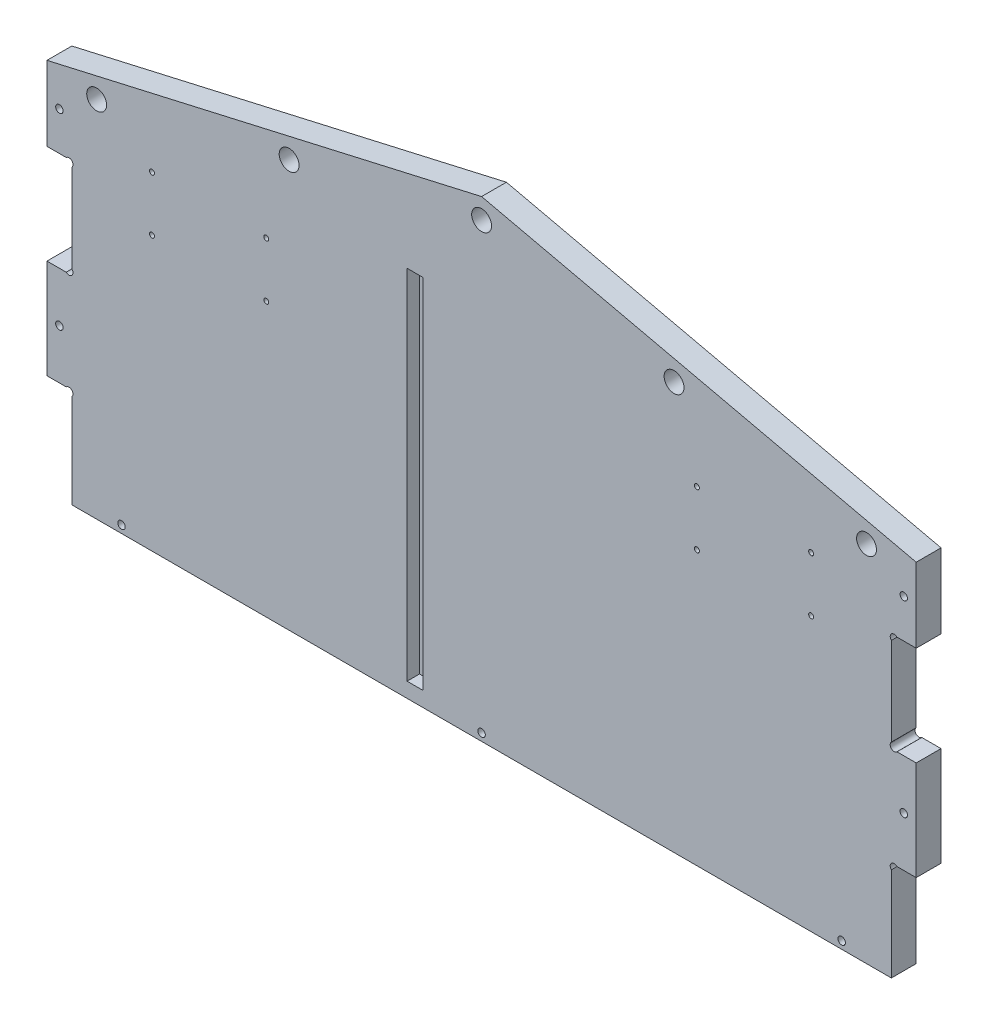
ISO-10303-21;
HEADER;
FILE_DESCRIPTION(('STEP AP214'),'2;1');
FILE_NAME('part.step','',(''),(''),'','','');
FILE_SCHEMA(('AUTOMOTIVE_DESIGN { 1 0 10303 214 1 1 1 1 }'));
ENDSEC;
DATA;
#1=APPLICATION_CONTEXT('core data for automotive mechanical design processes');
#2=APPLICATION_PROTOCOL_DEFINITION('international standard','automotive_design',2000,#1);
#3=PRODUCT_CONTEXT('',#1,'mechanical');
#4=PRODUCT('Part','Part','',(#3));
#5=PRODUCT_RELATED_PRODUCT_CATEGORY('part','',(#4));
#6=PRODUCT_DEFINITION_FORMATION('','',#4);
#7=PRODUCT_DEFINITION_CONTEXT('part definition',#1,'design');
#8=PRODUCT_DEFINITION('design','',#6,#7);
#9=PRODUCT_DEFINITION_SHAPE('','',#8);
#10=(LENGTH_UNIT() NAMED_UNIT(*) SI_UNIT(.MILLI.,.METRE.));
#11=(NAMED_UNIT(*) PLANE_ANGLE_UNIT() SI_UNIT($,.RADIAN.));
#12=(NAMED_UNIT(*) SI_UNIT($,.STERADIAN.) SOLID_ANGLE_UNIT());
#13=UNCERTAINTY_MEASURE_WITH_UNIT(LENGTH_MEASURE(1.E-05),#10,'distance_accuracy_value','');
#14=(GEOMETRIC_REPRESENTATION_CONTEXT(3) GLOBAL_UNCERTAINTY_ASSIGNED_CONTEXT((#13)) GLOBAL_UNIT_ASSIGNED_CONTEXT((#10,
#11,#12)) REPRESENTATION_CONTEXT('',''));
#15=CARTESIAN_POINT('',(0.,0.,0.));
#16=DIRECTION('',(0.,0.,1.));
#17=DIRECTION('',(1.,0.,0.));
#18=AXIS2_PLACEMENT_3D('',#15,#16,#17);
#19=CARTESIAN_POINT('',(0.,80.,10.));
#20=DIRECTION('',(1.,0.,0.));
#21=DIRECTION('',(0.,0.,-1.));
#22=AXIS2_PLACEMENT_3D('',#19,#20,#21);
#23=PLANE('',#22);
#24=DIRECTION('',(0.,-1.,0.));
#25=VECTOR('',#24,1.);
#26=CARTESIAN_POINT('',(0.,80.,0.));
#27=LINE('',#26,#25);
#28=CARTESIAN_POINT('',(0.,80.,0.));
#29=VERTEX_POINT('',#28);
#30=CARTESIAN_POINT('',(0.,40.,0.));
#31=VERTEX_POINT('',#30);
#32=EDGE_CURVE('E362',#29,#31,#27,.T.);
#33=ORIENTED_EDGE('',*,*,#32,.T.);
#34=DIRECTION('',(0.,0.,-1.));
#35=VECTOR('',#34,1.);
#36=CARTESIAN_POINT('',(0.,40.,10.));
#37=LINE('',#36,#35);
#38=CARTESIAN_POINT('',(0.,40.,10.));
#39=VERTEX_POINT('',#38);
#40=EDGE_CURVE('E472',#39,#31,#37,.T.);
#41=ORIENTED_EDGE('',*,*,#40,.F.);
#42=DIRECTION('',(0.,-1.,0.));
#43=VECTOR('',#42,1.);
#44=CARTESIAN_POINT('',(0.,80.,10.));
#45=LINE('',#44,#43);
#46=CARTESIAN_POINT('',(0.,80.,10.));
#47=VERTEX_POINT('',#46);
#48=EDGE_CURVE('E402',#47,#39,#45,.T.);
#49=ORIENTED_EDGE('',*,*,#48,.F.);
#50=DIRECTION('',(0.,0.,-1.));
#51=VECTOR('',#50,1.);
#52=CARTESIAN_POINT('',(0.,80.,10.));
#53=LINE('',#52,#51);
#54=EDGE_CURVE('E442',#47,#29,#53,.T.);
#55=ORIENTED_EDGE('',*,*,#54,.T.);
#56=EDGE_LOOP('',(#33,#41,#49,#55));
#57=FACE_BOUND('',#56,.T.);
#58=ADVANCED_FACE('F26',(#57),#23,.F.);
#59=CARTESIAN_POINT('',(0.,40.,10.));
#60=DIRECTION('',(0.,1.,0.));
#61=DIRECTION('',(0.,0.,1.));
#62=AXIS2_PLACEMENT_3D('',#59,#60,#61);
#63=PLANE('',#62);
#64=DIRECTION('',(1.,0.,0.));
#65=VECTOR('',#64,1.);
#66=CARTESIAN_POINT('',(0.,40.,0.));
#67=LINE('',#66,#65);
#68=CARTESIAN_POINT('',(7.73725830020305,40.,0.));
#69=VERTEX_POINT('',#68);
#70=EDGE_CURVE('E365',#31,#69,#67,.T.);
#71=ORIENTED_EDGE('',*,*,#70,.T.);
#72=DIRECTION('',(0.,0.,1.));
#73=VECTOR('',#72,1.);
#74=CARTESIAN_POINT('',(7.73725830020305,40.,0.));
#75=LINE('',#74,#73);
#76=CARTESIAN_POINT('',(7.73725830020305,40.,10.));
#77=VERTEX_POINT('',#76);
#78=EDGE_CURVE('E343',#69,#77,#75,.T.);
#79=ORIENTED_EDGE('',*,*,#78,.T.);
#80=DIRECTION('',(1.,0.,0.));
#81=VECTOR('',#80,1.);
#82=CARTESIAN_POINT('',(0.,40.,10.));
#83=LINE('',#82,#81);
#84=EDGE_CURVE('E405',#39,#77,#83,.T.);
#85=ORIENTED_EDGE('',*,*,#84,.F.);
#86=ORIENTED_EDGE('',*,*,#40,.T.);
#87=EDGE_LOOP('',(#71,#79,#85,#86));
#88=FACE_BOUND('',#87,.T.);
#89=ADVANCED_FACE('F526',(#88),#63,.F.);
#90=CARTESIAN_POINT('',(10.,40.,10.));
#91=DIRECTION('',(1.,0.,0.));
#92=DIRECTION('',(0.,0.,-1.));
#93=AXIS2_PLACEMENT_3D('',#90,#91,#92);
#94=PLANE('',#93);
#95=DIRECTION('',(0.,-1.,0.));
#96=VECTOR('',#95,1.);
#97=CARTESIAN_POINT('',(10.,40.,10.));
#98=LINE('',#97,#96);
#99=CARTESIAN_POINT('',(10.,37.7372583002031,10.));
#100=VERTEX_POINT('',#99);
#101=CARTESIAN_POINT('',(10.,0.,10.));
#102=VERTEX_POINT('',#101);
#103=EDGE_CURVE('E408',#100,#102,#98,.T.);
#104=ORIENTED_EDGE('',*,*,#103,.F.);
#105=DIRECTION('',(0.,0.,1.));
#106=VECTOR('',#105,1.);
#107=CARTESIAN_POINT('',(10.,37.7372583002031,0.));
#108=LINE('',#107,#106);
#109=CARTESIAN_POINT('',(10.,37.7372583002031,0.));
#110=VERTEX_POINT('',#109);
#111=EDGE_CURVE('E340',#100,#110,#108,.F.);
#112=ORIENTED_EDGE('',*,*,#111,.T.);
#113=DIRECTION('',(0.,-1.,0.));
#114=VECTOR('',#113,1.);
#115=CARTESIAN_POINT('',(10.,40.,0.));
#116=LINE('',#115,#114);
#117=CARTESIAN_POINT('',(10.,0.,0.));
#118=VERTEX_POINT('',#117);
#119=EDGE_CURVE('E368',#110,#118,#116,.T.);
#120=ORIENTED_EDGE('',*,*,#119,.T.);
#121=DIRECTION('',(0.,0.,-1.));
#122=VECTOR('',#121,1.);
#123=CARTESIAN_POINT('',(10.,0.,10.));
#124=LINE('',#123,#122);
#125=EDGE_CURVE('E469',#102,#118,#124,.T.);
#126=ORIENTED_EDGE('',*,*,#125,.F.);
#127=EDGE_LOOP('',(#104,#112,#120,#126));
#128=FACE_BOUND('',#127,.T.);
#129=ADVANCED_FACE('F521',(#128),#94,.F.);
#130=CARTESIAN_POINT('',(10.,0.,10.));
#131=DIRECTION('',(0.,1.,0.));
#132=DIRECTION('',(0.,0.,1.));
#133=AXIS2_PLACEMENT_3D('',#130,#131,#132);
#134=PLANE('',#133);
#135=DIRECTION('',(1.,0.,0.));
#136=VECTOR('',#135,1.);
#137=CARTESIAN_POINT('',(10.,0.,0.));
#138=LINE('',#137,#136);
#139=CARTESIAN_POINT('',(340.,0.,0.));
#140=VERTEX_POINT('',#139);
#141=EDGE_CURVE('E370',#118,#140,#138,.T.);
#142=ORIENTED_EDGE('',*,*,#141,.T.);
#143=DIRECTION('',(0.,0.,-1.));
#144=VECTOR('',#143,1.);
#145=CARTESIAN_POINT('',(340.,0.,10.));
#146=LINE('',#145,#144);
#147=CARTESIAN_POINT('',(340.,0.,10.));
#148=VERTEX_POINT('',#147);
#149=EDGE_CURVE('E466',#148,#140,#146,.T.);
#150=ORIENTED_EDGE('',*,*,#149,.F.);
#151=DIRECTION('',(1.,0.,0.));
#152=VECTOR('',#151,1.);
#153=CARTESIAN_POINT('',(10.,0.,10.));
#154=LINE('',#153,#152);
#155=EDGE_CURVE('E410',#102,#148,#154,.T.);
#156=ORIENTED_EDGE('',*,*,#155,.F.);
#157=ORIENTED_EDGE('',*,*,#125,.T.);
#158=EDGE_LOOP('',(#142,#150,#156,#157));
#159=FACE_BOUND('',#158,.T.);
#160=ADVANCED_FACE('F516',(#159),#134,.F.);
#161=CARTESIAN_POINT('',(340.,0.,10.));
#162=DIRECTION('',(-1.,0.,0.));
#163=DIRECTION('',(0.,0.,1.));
#164=AXIS2_PLACEMENT_3D('',#161,#162,#163);
#165=PLANE('',#164);
#166=DIRECTION('',(0.,1.,0.));
#167=VECTOR('',#166,1.);
#168=CARTESIAN_POINT('',(340.,0.,0.));
#169=LINE('',#168,#167);
#170=CARTESIAN_POINT('',(340.,37.7372583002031,0.));
#171=VERTEX_POINT('',#170);
#172=EDGE_CURVE('E372',#140,#171,#169,.T.);
#173=ORIENTED_EDGE('',*,*,#172,.T.);
#174=DIRECTION('',(0.,0.,1.));
#175=VECTOR('',#174,1.);
#176=CARTESIAN_POINT('',(340.,37.7372583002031,0.));
#177=LINE('',#176,#175);
#178=CARTESIAN_POINT('',(340.,37.7372583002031,10.));
#179=VERTEX_POINT('',#178);
#180=EDGE_CURVE('E48',#171,#179,#177,.T.);
#181=ORIENTED_EDGE('',*,*,#180,.T.);
#182=DIRECTION('',(0.,1.,0.));
#183=VECTOR('',#182,1.);
#184=CARTESIAN_POINT('',(340.,0.,10.));
#185=LINE('',#184,#183);
#186=EDGE_CURVE('E412',#148,#179,#185,.T.);
#187=ORIENTED_EDGE('',*,*,#186,.F.);
#188=ORIENTED_EDGE('',*,*,#149,.T.);
#189=EDGE_LOOP('',(#173,#181,#187,#188));
#190=FACE_BOUND('',#189,.T.);
#191=ADVANCED_FACE('F510',(#190),#165,.F.);
#192=CARTESIAN_POINT('',(340.,40.,10.));
#193=DIRECTION('',(0.,1.,0.));
#194=DIRECTION('',(0.,0.,1.));
#195=AXIS2_PLACEMENT_3D('',#192,#193,#194);
#196=PLANE('',#195);
#197=DIRECTION('',(1.,0.,0.));
#198=VECTOR('',#197,1.);
#199=CARTESIAN_POINT('',(340.,40.,10.));
#200=LINE('',#199,#198);
#201=CARTESIAN_POINT('',(342.262741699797,40.,10.));
#202=VERTEX_POINT('',#201);
#203=CARTESIAN_POINT('',(350.,40.,10.));
#204=VERTEX_POINT('',#203);
#205=EDGE_CURVE('E415',#202,#204,#200,.T.);
#206=ORIENTED_EDGE('',*,*,#205,.F.);
#207=DIRECTION('',(0.,0.,1.));
#208=VECTOR('',#207,1.);
#209=CARTESIAN_POINT('',(342.262741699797,40.,0.));
#210=LINE('',#209,#208);
#211=CARTESIAN_POINT('',(342.262741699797,40.,0.));
#212=VERTEX_POINT('',#211);
#213=EDGE_CURVE('E317',#202,#212,#210,.F.);
#214=ORIENTED_EDGE('',*,*,#213,.T.);
#215=DIRECTION('',(1.,0.,0.));
#216=VECTOR('',#215,1.);
#217=CARTESIAN_POINT('',(340.,40.,0.));
#218=LINE('',#217,#216);
#219=CARTESIAN_POINT('',(350.,40.,0.));
#220=VERTEX_POINT('',#219);
#221=EDGE_CURVE('E375',#212,#220,#218,.T.);
#222=ORIENTED_EDGE('',*,*,#221,.T.);
#223=DIRECTION('',(0.,0.,-1.));
#224=VECTOR('',#223,1.);
#225=CARTESIAN_POINT('',(350.,40.,10.));
#226=LINE('',#225,#224);
#227=EDGE_CURVE('E463',#204,#220,#226,.T.);
#228=ORIENTED_EDGE('',*,*,#227,.F.);
#229=EDGE_LOOP('',(#206,#214,#222,#228));
#230=FACE_BOUND('',#229,.T.);
#231=ADVANCED_FACE('F504',(#230),#196,.F.);
#232=CARTESIAN_POINT('',(350.,40.,10.));
#233=DIRECTION('',(-1.,0.,0.));
#234=DIRECTION('',(0.,0.,1.));
#235=AXIS2_PLACEMENT_3D('',#232,#233,#234);
#236=PLANE('',#235);
#237=DIRECTION('',(0.,1.,0.));
#238=VECTOR('',#237,1.);
#239=CARTESIAN_POINT('',(350.,40.,0.));
#240=LINE('',#239,#238);
#241=CARTESIAN_POINT('',(350.,80.,0.));
#242=VERTEX_POINT('',#241);
#243=EDGE_CURVE('E377',#220,#242,#240,.T.);
#244=ORIENTED_EDGE('',*,*,#243,.T.);
#245=DIRECTION('',(0.,0.,-1.));
#246=VECTOR('',#245,1.);
#247=CARTESIAN_POINT('',(350.,80.,10.));
#248=LINE('',#247,#246);
#249=CARTESIAN_POINT('',(350.,80.,10.));
#250=VERTEX_POINT('',#249);
#251=EDGE_CURVE('E460',#250,#242,#248,.T.);
#252=ORIENTED_EDGE('',*,*,#251,.F.);
#253=DIRECTION('',(0.,1.,0.));
#254=VECTOR('',#253,1.);
#255=CARTESIAN_POINT('',(350.,40.,10.));
#256=LINE('',#255,#254);
#257=EDGE_CURVE('E417',#204,#250,#256,.T.);
#258=ORIENTED_EDGE('',*,*,#257,.F.);
#259=ORIENTED_EDGE('',*,*,#227,.T.);
#260=EDGE_LOOP('',(#244,#252,#258,#259));
#261=FACE_BOUND('',#260,.T.);
#262=ADVANCED_FACE('F499',(#261),#236,.F.);
#263=CARTESIAN_POINT('',(350.,80.,10.));
#264=DIRECTION('',(0.,-1.,0.));
#265=DIRECTION('',(0.,0.,-1.));
#266=AXIS2_PLACEMENT_3D('',#263,#264,#265);
#267=PLANE('',#266);
#268=DIRECTION('',(-1.,0.,0.));
#269=VECTOR('',#268,1.);
#270=CARTESIAN_POINT('',(350.,80.,0.));
#271=LINE('',#270,#269);
#272=CARTESIAN_POINT('',(342.262741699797,80.,0.));
#273=VERTEX_POINT('',#272);
#274=EDGE_CURVE('E379',#242,#273,#271,.T.);
#275=ORIENTED_EDGE('',*,*,#274,.T.);
#276=DIRECTION('',(0.,0.,1.));
#277=VECTOR('',#276,1.);
#278=CARTESIAN_POINT('',(342.262741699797,80.,0.));
#279=LINE('',#278,#277);
#280=CARTESIAN_POINT('',(342.262741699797,80.,10.));
#281=VERTEX_POINT('',#280);
#282=EDGE_CURVE('E326',#273,#281,#279,.T.);
#283=ORIENTED_EDGE('',*,*,#282,.T.);
#284=DIRECTION('',(-1.,0.,0.));
#285=VECTOR('',#284,1.);
#286=CARTESIAN_POINT('',(350.,80.,10.));
#287=LINE('',#286,#285);
#288=EDGE_CURVE('E419',#250,#281,#287,.T.);
#289=ORIENTED_EDGE('',*,*,#288,.F.);
#290=ORIENTED_EDGE('',*,*,#251,.T.);
#291=EDGE_LOOP('',(#275,#283,#289,#290));
#292=FACE_BOUND('',#291,.T.);
#293=ADVANCED_FACE('F494',(#292),#267,.F.);
#294=CARTESIAN_POINT('',(340.,80.,10.));
#295=DIRECTION('',(-1.,0.,0.));
#296=DIRECTION('',(0.,0.,1.));
#297=AXIS2_PLACEMENT_3D('',#294,#295,#296);
#298=PLANE('',#297);
#299=DIRECTION('',(0.,1.,0.));
#300=VECTOR('',#299,1.);
#301=CARTESIAN_POINT('',(340.,80.,10.));
#302=LINE('',#301,#300);
#303=CARTESIAN_POINT('',(340.,82.2627416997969,10.));
#304=VERTEX_POINT('',#303);
#305=CARTESIAN_POINT('',(340.,117.737258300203,10.));
#306=VERTEX_POINT('',#305);
#307=EDGE_CURVE('E422',#304,#306,#302,.T.);
#308=ORIENTED_EDGE('',*,*,#307,.F.);
#309=DIRECTION('',(0.,0.,1.));
#310=VECTOR('',#309,1.);
#311=CARTESIAN_POINT('',(340.,82.2627416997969,0.));
#312=LINE('',#311,#310);
#313=CARTESIAN_POINT('',(340.,82.2627416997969,0.));
#314=VERTEX_POINT('',#313);
#315=EDGE_CURVE('E323',#304,#314,#312,.F.);
#316=ORIENTED_EDGE('',*,*,#315,.T.);
#317=DIRECTION('',(0.,1.,0.));
#318=VECTOR('',#317,1.);
#319=CARTESIAN_POINT('',(340.,80.,0.));
#320=LINE('',#319,#318);
#321=CARTESIAN_POINT('',(340.,117.737258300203,0.));
#322=VERTEX_POINT('',#321);
#323=EDGE_CURVE('E382',#314,#322,#320,.T.);
#324=ORIENTED_EDGE('',*,*,#323,.T.);
#325=DIRECTION('',(0.,0.,1.));
#326=VECTOR('',#325,1.);
#327=CARTESIAN_POINT('',(340.,117.737258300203,0.));
#328=LINE('',#327,#326);
#329=EDGE_CURVE('E335',#322,#306,#328,.T.);
#330=ORIENTED_EDGE('',*,*,#329,.T.);
#331=EDGE_LOOP('',(#308,#316,#324,#330));
#332=FACE_BOUND('',#331,.T.);
#333=ADVANCED_FACE('F582',(#332),#298,.F.);
#334=CARTESIAN_POINT('',(340.,120.,10.));
#335=DIRECTION('',(0.,1.,0.));
#336=DIRECTION('',(-1.,0.,0.));
#337=AXIS2_PLACEMENT_3D('',#334,#335,#336);
#338=PLANE('',#337);
#339=DIRECTION('',(1.,0.,0.));
#340=VECTOR('',#339,1.);
#341=CARTESIAN_POINT('',(340.,120.,10.));
#342=LINE('',#341,#340);
#343=CARTESIAN_POINT('',(342.262741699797,120.,10.));
#344=VERTEX_POINT('',#343);
#345=CARTESIAN_POINT('',(350.,120.,10.));
#346=VERTEX_POINT('',#345);
#347=EDGE_CURVE('E424',#344,#346,#342,.T.);
#348=ORIENTED_EDGE('',*,*,#347,.F.);
#349=DIRECTION('',(0.,0.,1.));
#350=VECTOR('',#349,1.);
#351=CARTESIAN_POINT('',(342.262741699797,120.,0.));
#352=LINE('',#351,#350);
#353=CARTESIAN_POINT('',(342.262741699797,120.,0.));
#354=VERTEX_POINT('',#353);
#355=EDGE_CURVE('E332',#344,#354,#352,.F.);
#356=ORIENTED_EDGE('',*,*,#355,.T.);
#357=DIRECTION('',(1.,0.,0.));
#358=VECTOR('',#357,1.);
#359=CARTESIAN_POINT('',(340.,120.,0.));
#360=LINE('',#359,#358);
#361=CARTESIAN_POINT('',(350.,120.,0.));
#362=VERTEX_POINT('',#361);
#363=EDGE_CURVE('E384',#354,#362,#360,.T.);
#364=ORIENTED_EDGE('',*,*,#363,.T.);
#365=DIRECTION('',(0.,0.,-1.));
#366=VECTOR('',#365,1.);
#367=CARTESIAN_POINT('',(350.,120.,10.));
#368=LINE('',#367,#366);
#369=EDGE_CURVE('E457',#346,#362,#368,.T.);
#370=ORIENTED_EDGE('',*,*,#369,.F.);
#371=EDGE_LOOP('',(#348,#356,#364,#370));
#372=FACE_BOUND('',#371,.T.);
#373=ADVANCED_FACE('F575',(#372),#338,.F.);
#374=CARTESIAN_POINT('',(350.,120.,10.));
#375=DIRECTION('',(-1.,0.,0.));
#376=DIRECTION('',(0.,0.,1.));
#377=AXIS2_PLACEMENT_3D('',#374,#375,#376);
#378=PLANE('',#377);
#379=DIRECTION('',(0.,1.,0.));
#380=VECTOR('',#379,1.);
#381=CARTESIAN_POINT('',(350.,120.,0.));
#382=LINE('',#381,#380);
#383=CARTESIAN_POINT('',(350.,150.,0.));
#384=VERTEX_POINT('',#383);
#385=EDGE_CURVE('E386',#362,#384,#382,.T.);
#386=ORIENTED_EDGE('',*,*,#385,.T.);
#387=DIRECTION('',(0.,0.,-1.));
#388=VECTOR('',#387,1.);
#389=CARTESIAN_POINT('',(350.,150.,10.));
#390=LINE('',#389,#388);
#391=CARTESIAN_POINT('',(350.,150.,10.));
#392=VERTEX_POINT('',#391);
#393=EDGE_CURVE('E454',#392,#384,#390,.T.);
#394=ORIENTED_EDGE('',*,*,#393,.F.);
#395=DIRECTION('',(0.,1.,0.));
#396=VECTOR('',#395,1.);
#397=CARTESIAN_POINT('',(350.,120.,10.));
#398=LINE('',#397,#396);
#399=EDGE_CURVE('E426',#346,#392,#398,.T.);
#400=ORIENTED_EDGE('',*,*,#399,.F.);
#401=ORIENTED_EDGE('',*,*,#369,.T.);
#402=EDGE_LOOP('',(#386,#394,#400,#401));
#403=FACE_BOUND('',#402,.T.);
#404=ADVANCED_FACE('F571',(#403),#378,.F.);
#405=CARTESIAN_POINT('',(350.,150.,10.));
#406=DIRECTION('',(-0.222824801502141,-0.974858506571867,0.));
#407=DIRECTION('',(0.974858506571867,-0.222824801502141,0.));
#408=AXIS2_PLACEMENT_3D('',#405,#406,#407);
#409=PLANE('',#408);
#410=DIRECTION('',(-0.974858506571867,0.222824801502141,0.));
#411=VECTOR('',#410,1.);
#412=CARTESIAN_POINT('',(350.,150.,0.));
#413=LINE('',#412,#411);
#414=CARTESIAN_POINT('',(175.,190.,0.));
#415=VERTEX_POINT('',#414);
#416=EDGE_CURVE('E388',#384,#415,#413,.T.);
#417=ORIENTED_EDGE('',*,*,#416,.T.);
#418=DIRECTION('',(0.,0.,-1.));
#419=VECTOR('',#418,1.);
#420=CARTESIAN_POINT('',(175.,190.,10.));
#421=LINE('',#420,#419);
#422=CARTESIAN_POINT('',(175.,190.,10.));
#423=VERTEX_POINT('',#422);
#424=EDGE_CURVE('E451',#423,#415,#421,.T.);
#425=ORIENTED_EDGE('',*,*,#424,.F.);
#426=DIRECTION('',(-0.974858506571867,0.222824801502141,0.));
#427=VECTOR('',#426,1.);
#428=CARTESIAN_POINT('',(350.,150.,10.));
#429=LINE('',#428,#427);
#430=EDGE_CURVE('E428',#392,#423,#429,.T.);
#431=ORIENTED_EDGE('',*,*,#430,.F.);
#432=ORIENTED_EDGE('',*,*,#393,.T.);
#433=EDGE_LOOP('',(#417,#425,#431,#432));
#434=FACE_BOUND('',#433,.T.);
#435=ADVANCED_FACE('F566',(#434),#409,.F.);
#436=CARTESIAN_POINT('',(175.,190.,10.));
#437=DIRECTION('',(0.222824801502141,-0.974858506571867,0.));
#438=DIRECTION('',(0.974858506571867,0.222824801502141,0.));
#439=AXIS2_PLACEMENT_3D('',#436,#437,#438);
#440=PLANE('',#439);
#441=DIRECTION('',(-0.974858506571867,-0.222824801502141,0.));
#442=VECTOR('',#441,1.);
#443=CARTESIAN_POINT('',(175.,190.,0.));
#444=LINE('',#443,#442);
#445=CARTESIAN_POINT('',(0.,150.,0.));
#446=VERTEX_POINT('',#445);
#447=EDGE_CURVE('E390',#415,#446,#444,.T.);
#448=ORIENTED_EDGE('',*,*,#447,.T.);
#449=DIRECTION('',(0.,0.,-1.));
#450=VECTOR('',#449,1.);
#451=CARTESIAN_POINT('',(0.,150.,10.));
#452=LINE('',#451,#450);
#453=CARTESIAN_POINT('',(0.,150.,10.));
#454=VERTEX_POINT('',#453);
#455=EDGE_CURVE('E448',#454,#446,#452,.T.);
#456=ORIENTED_EDGE('',*,*,#455,.F.);
#457=DIRECTION('',(-0.974858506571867,-0.222824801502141,0.));
#458=VECTOR('',#457,1.);
#459=CARTESIAN_POINT('',(175.,190.,10.));
#460=LINE('',#459,#458);
#461=EDGE_CURVE('E430',#423,#454,#460,.T.);
#462=ORIENTED_EDGE('',*,*,#461,.F.);
#463=ORIENTED_EDGE('',*,*,#424,.T.);
#464=EDGE_LOOP('',(#448,#456,#462,#463));
#465=FACE_BOUND('',#464,.T.);
#466=ADVANCED_FACE('F560',(#465),#440,.F.);
#467=CARTESIAN_POINT('',(0.,150.,10.));
#468=DIRECTION('',(1.,0.,0.));
#469=DIRECTION('',(0.,0.,-1.));
#470=AXIS2_PLACEMENT_3D('',#467,#468,#469);
#471=PLANE('',#470);
#472=DIRECTION('',(0.,-1.,0.));
#473=VECTOR('',#472,1.);
#474=CARTESIAN_POINT('',(0.,150.,0.));
#475=LINE('',#474,#473);
#476=CARTESIAN_POINT('',(0.,120.,0.));
#477=VERTEX_POINT('',#476);
#478=EDGE_CURVE('E392',#446,#477,#475,.T.);
#479=ORIENTED_EDGE('',*,*,#478,.T.);
#480=DIRECTION('',(0.,0.,-1.));
#481=VECTOR('',#480,1.);
#482=CARTESIAN_POINT('',(0.,120.,10.));
#483=LINE('',#482,#481);
#484=CARTESIAN_POINT('',(0.,120.,10.));
#485=VERTEX_POINT('',#484);
#486=EDGE_CURVE('E445',#485,#477,#483,.T.);
#487=ORIENTED_EDGE('',*,*,#486,.F.);
#488=DIRECTION('',(0.,-1.,0.));
#489=VECTOR('',#488,1.);
#490=CARTESIAN_POINT('',(0.,150.,10.));
#491=LINE('',#490,#489);
#492=EDGE_CURVE('E432',#454,#485,#491,.T.);
#493=ORIENTED_EDGE('',*,*,#492,.F.);
#494=ORIENTED_EDGE('',*,*,#455,.T.);
#495=EDGE_LOOP('',(#479,#487,#493,#494));
#496=FACE_BOUND('',#495,.T.);
#497=ADVANCED_FACE('F556',(#496),#471,.F.);
#498=CARTESIAN_POINT('',(0.,120.,10.));
#499=DIRECTION('',(0.,1.,0.));
#500=DIRECTION('',(-1.,0.,0.));
#501=AXIS2_PLACEMENT_3D('',#498,#499,#500);
#502=PLANE('',#501);
#503=DIRECTION('',(1.,0.,0.));
#504=VECTOR('',#503,1.);
#505=CARTESIAN_POINT('',(0.,120.,0.));
#506=LINE('',#505,#504);
#507=CARTESIAN_POINT('',(7.73725830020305,120.,0.));
#508=VERTEX_POINT('',#507);
#509=EDGE_CURVE('E394',#477,#508,#506,.T.);
#510=ORIENTED_EDGE('',*,*,#509,.T.);
#511=DIRECTION('',(0.,0.,1.));
#512=VECTOR('',#511,1.);
#513=CARTESIAN_POINT('',(7.73725830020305,120.,0.));
#514=LINE('',#513,#512);
#515=CARTESIAN_POINT('',(7.73725830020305,120.,10.));
#516=VERTEX_POINT('',#515);
#517=EDGE_CURVE('E359',#508,#516,#514,.T.);
#518=ORIENTED_EDGE('',*,*,#517,.T.);
#519=DIRECTION('',(1.,0.,0.));
#520=VECTOR('',#519,1.);
#521=CARTESIAN_POINT('',(0.,120.,10.));
#522=LINE('',#521,#520);
#523=EDGE_CURVE('E434',#485,#516,#522,.T.);
#524=ORIENTED_EDGE('',*,*,#523,.F.);
#525=ORIENTED_EDGE('',*,*,#486,.T.);
#526=EDGE_LOOP('',(#510,#518,#524,#525));
#527=FACE_BOUND('',#526,.T.);
#528=ADVANCED_FACE('F551',(#527),#502,.F.);
#529=CARTESIAN_POINT('',(10.,120.,10.));
#530=DIRECTION('',(1.,0.,0.));
#531=DIRECTION('',(0.,0.,-1.));
#532=AXIS2_PLACEMENT_3D('',#529,#530,#531);
#533=PLANE('',#532);
#534=DIRECTION('',(0.,-1.,0.));
#535=VECTOR('',#534,1.);
#536=CARTESIAN_POINT('',(10.,120.,0.));
#537=LINE('',#536,#535);
#538=CARTESIAN_POINT('',(10.,117.737258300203,0.));
#539=VERTEX_POINT('',#538);
#540=CARTESIAN_POINT('',(10.,82.262741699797,0.));
#541=VERTEX_POINT('',#540);
#542=EDGE_CURVE('E397',#539,#541,#537,.T.);
#543=ORIENTED_EDGE('',*,*,#542,.T.);
#544=DIRECTION('',(0.,0.,1.));
#545=VECTOR('',#544,1.);
#546=CARTESIAN_POINT('',(10.,82.262741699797,0.));
#547=LINE('',#546,#545);
#548=CARTESIAN_POINT('',(10.,82.262741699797,10.));
#549=VERTEX_POINT('',#548);
#550=EDGE_CURVE('E351',#541,#549,#547,.T.);
#551=ORIENTED_EDGE('',*,*,#550,.T.);
#552=DIRECTION('',(0.,-1.,0.));
#553=VECTOR('',#552,1.);
#554=CARTESIAN_POINT('',(10.,120.,10.));
#555=LINE('',#554,#553);
#556=CARTESIAN_POINT('',(10.,117.737258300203,10.));
#557=VERTEX_POINT('',#556);
#558=EDGE_CURVE('E437',#557,#549,#555,.T.);
#559=ORIENTED_EDGE('',*,*,#558,.F.);
#560=DIRECTION('',(0.,0.,1.));
#561=VECTOR('',#560,1.);
#562=CARTESIAN_POINT('',(10.,117.737258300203,0.));
#563=LINE('',#562,#561);
#564=EDGE_CURVE('E356',#557,#539,#563,.F.);
#565=ORIENTED_EDGE('',*,*,#564,.T.);
#566=EDGE_LOOP('',(#543,#551,#559,#565));
#567=FACE_BOUND('',#566,.T.);
#568=ADVANCED_FACE('F541',(#567),#533,.F.);
#569=CARTESIAN_POINT('',(10.,80.,10.));
#570=DIRECTION('',(0.,-1.,0.));
#571=DIRECTION('',(0.,0.,-1.));
#572=AXIS2_PLACEMENT_3D('',#569,#570,#571);
#573=PLANE('',#572);
#574=DIRECTION('',(-1.,0.,0.));
#575=VECTOR('',#574,1.);
#576=CARTESIAN_POINT('',(10.,80.,10.));
#577=LINE('',#576,#575);
#578=CARTESIAN_POINT('',(7.73725830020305,80.,10.));
#579=VERTEX_POINT('',#578);
#580=EDGE_CURVE('E440',#579,#47,#577,.T.);
#581=ORIENTED_EDGE('',*,*,#580,.F.);
#582=DIRECTION('',(0.,0.,1.));
#583=VECTOR('',#582,1.);
#584=CARTESIAN_POINT('',(7.73725830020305,80.,0.));
#585=LINE('',#584,#583);
#586=CARTESIAN_POINT('',(7.73725830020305,80.,0.));
#587=VERTEX_POINT('',#586);
#588=EDGE_CURVE('E348',#579,#587,#585,.F.);
#589=ORIENTED_EDGE('',*,*,#588,.T.);
#590=DIRECTION('',(-1.,0.,0.));
#591=VECTOR('',#590,1.);
#592=CARTESIAN_POINT('',(10.,80.,0.));
#593=LINE('',#592,#591);
#594=EDGE_CURVE('E400',#587,#29,#593,.T.);
#595=ORIENTED_EDGE('',*,*,#594,.T.);
#596=ORIENTED_EDGE('',*,*,#54,.F.);
#597=EDGE_LOOP('',(#581,#589,#595,#596));
#598=FACE_BOUND('',#597,.T.);
#599=ADVANCED_FACE('F535',(#598),#573,.F.);
#600=CARTESIAN_POINT('',(0.,40.,10.));
#601=DIRECTION('',(0.,0.,1.));
#602=DIRECTION('',(1.,0.,0.));
#603=AXIS2_PLACEMENT_3D('',#600,#601,#602);
#604=PLANE('',#603);
#605=CARTESIAN_POINT('',(307.70255344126,110.177640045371,10.));
#606=DIRECTION('',(0.,0.,1.));
#607=DIRECTION('',(1.,0.,0.));
#608=AXIS2_PLACEMENT_3D('',#605,#606,#607);
#609=CIRCLE('',#608,0.999999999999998);
#610=CARTESIAN_POINT('',(308.70255344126,110.177640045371,10.));
#611=VERTEX_POINT('',#610);
#612=EDGE_CURVE('E897',#611,#611,#609,.T.);
#613=ORIENTED_EDGE('',*,*,#612,.F.);
#614=EDGE_LOOP('',(#613));
#615=FACE_BOUND('',#614,.T.);
#616=CARTESIAN_POINT('',(307.70255344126,132.177640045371,10.));
#617=DIRECTION('',(0.,0.,1.));
#618=DIRECTION('',(1.,0.,0.));
#619=AXIS2_PLACEMENT_3D('',#616,#617,#618);
#620=CIRCLE('',#619,0.999999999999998);
#621=CARTESIAN_POINT('',(308.70255344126,132.177640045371,10.));
#622=VERTEX_POINT('',#621);
#623=EDGE_CURVE('E903',#622,#622,#620,.T.);
#624=ORIENTED_EDGE('',*,*,#623,.F.);
#625=EDGE_LOOP('',(#624));
#626=FACE_BOUND('',#625,.T.);
#627=CARTESIAN_POINT('',(42.29744655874,110.177640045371,10.));
#628=DIRECTION('',(0.,0.,1.));
#629=DIRECTION('',(1.,0.,0.));
#630=AXIS2_PLACEMENT_3D('',#627,#628,#629);
#631=CIRCLE('',#630,0.999999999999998);
#632=CARTESIAN_POINT('',(43.29744655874,110.177640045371,10.));
#633=VERTEX_POINT('',#632);
#634=EDGE_CURVE('E909',#633,#633,#631,.T.);
#635=ORIENTED_EDGE('',*,*,#634,.F.);
#636=EDGE_LOOP('',(#635));
#637=FACE_BOUND('',#636,.T.);
#638=CARTESIAN_POINT('',(42.29744655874,132.177640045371,10.));
#639=DIRECTION('',(0.,0.,1.));
#640=DIRECTION('',(1.,0.,0.));
#641=AXIS2_PLACEMENT_3D('',#638,#639,#640);
#642=CIRCLE('',#641,0.999999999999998);
#643=CARTESIAN_POINT('',(43.29744655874,132.177640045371,10.));
#644=VERTEX_POINT('',#643);
#645=EDGE_CURVE('E915',#644,#644,#642,.T.);
#646=ORIENTED_EDGE('',*,*,#645,.F.);
#647=EDGE_LOOP('',(#646));
#648=FACE_BOUND('',#647,.T.);
#649=CARTESIAN_POINT('',(88.29744655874,132.177640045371,10.));
#650=DIRECTION('',(0.,0.,1.));
#651=DIRECTION('',(1.,0.,0.));
#652=AXIS2_PLACEMENT_3D('',#649,#650,#651);
#653=CIRCLE('',#652,0.999999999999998);
#654=CARTESIAN_POINT('',(89.29744655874,132.177640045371,10.));
#655=VERTEX_POINT('',#654);
#656=EDGE_CURVE('E921',#655,#655,#653,.T.);
#657=ORIENTED_EDGE('',*,*,#656,.F.);
#658=EDGE_LOOP('',(#657));
#659=FACE_BOUND('',#658,.T.);
#660=CARTESIAN_POINT('',(88.29744655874,110.177640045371,10.));
#661=DIRECTION('',(0.,0.,1.));
#662=DIRECTION('',(1.,0.,0.));
#663=AXIS2_PLACEMENT_3D('',#660,#661,#662);
#664=CIRCLE('',#663,0.999999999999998);
#665=CARTESIAN_POINT('',(89.29744655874,110.177640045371,10.));
#666=VERTEX_POINT('',#665);
#667=EDGE_CURVE('E927',#666,#666,#664,.T.);
#668=ORIENTED_EDGE('',*,*,#667,.F.);
#669=EDGE_LOOP('',(#668));
#670=FACE_BOUND('',#669,.T.);
#671=CARTESIAN_POINT('',(261.70255344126,110.177640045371,10.));
#672=DIRECTION('',(0.,0.,1.));
#673=DIRECTION('',(1.,0.,0.));
#674=AXIS2_PLACEMENT_3D('',#671,#672,#673);
#675=CIRCLE('',#674,0.999999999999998);
#676=CARTESIAN_POINT('',(262.70255344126,110.177640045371,10.));
#677=VERTEX_POINT('',#676);
#678=EDGE_CURVE('E933',#677,#677,#675,.T.);
#679=ORIENTED_EDGE('',*,*,#678,.F.);
#680=EDGE_LOOP('',(#679));
#681=FACE_BOUND('',#680,.T.);
#682=CARTESIAN_POINT('',(261.70255344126,132.177640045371,10.));
#683=DIRECTION('',(0.,0.,1.));
#684=DIRECTION('',(1.,0.,0.));
#685=AXIS2_PLACEMENT_3D('',#682,#683,#684);
#686=CIRCLE('',#685,0.999999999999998);
#687=CARTESIAN_POINT('',(262.70255344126,132.177640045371,10.));
#688=VERTEX_POINT('',#687);
#689=EDGE_CURVE('E939',#688,#688,#686,.T.);
#690=ORIENTED_EDGE('',*,*,#689,.F.);
#691=EDGE_LOOP('',(#690));
#692=FACE_BOUND('',#691,.T.);
#693=DIRECTION('',(0.,1.,0.));
#694=VECTOR('',#693,1.);
#695=CARTESIAN_POINT('',(151.5,150.,10.));
#696=LINE('',#695,#694);
#697=CARTESIAN_POINT('',(151.5,6.00000000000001,10.));
#698=VERTEX_POINT('',#697);
#699=CARTESIAN_POINT('',(151.5,150.,10.));
#700=VERTEX_POINT('',#699);
#701=EDGE_CURVE('E40',#698,#700,#696,.T.);
#702=ORIENTED_EDGE('',*,*,#701,.F.);
#703=DIRECTION('',(1.,0.,0.));
#704=VECTOR('',#703,1.);
#705=CARTESIAN_POINT('',(151.5,6.00000000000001,10.));
#706=LINE('',#705,#704);
#707=CARTESIAN_POINT('',(145.,6.00000000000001,10.));
#708=VERTEX_POINT('',#707);
#709=EDGE_CURVE('E225',#708,#698,#706,.T.);
#710=ORIENTED_EDGE('',*,*,#709,.F.);
#711=DIRECTION('',(0.,-1.,0.));
#712=VECTOR('',#711,1.);
#713=CARTESIAN_POINT('',(145.,150.,10.));
#714=LINE('',#713,#712);
#715=CARTESIAN_POINT('',(145.,150.,10.));
#716=VERTEX_POINT('',#715);
#717=EDGE_CURVE('E207',#716,#708,#714,.T.);
#718=ORIENTED_EDGE('',*,*,#717,.F.);
#719=DIRECTION('',(-1.,0.,0.));
#720=VECTOR('',#719,1.);
#721=CARTESIAN_POINT('',(151.5,150.,10.));
#722=LINE('',#721,#720);
#723=EDGE_CURVE('E218',#700,#716,#722,.T.);
#724=ORIENTED_EDGE('',*,*,#723,.F.);
#725=EDGE_LOOP('',(#702,#710,#718,#724));
#726=FACE_BOUND('',#725,.T.);
#727=CARTESIAN_POINT('',(97.498748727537,164.079109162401,10.));
#728=DIRECTION('',(0.,0.,1.));
#729=DIRECTION('',(1.,0.,0.));
#730=AXIS2_PLACEMENT_3D('',#727,#728,#729);
#731=CIRCLE('',#730,4.00000000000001);
#732=CARTESIAN_POINT('',(101.498748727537,164.079109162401,10.));
#733=VERTEX_POINT('',#732);
#734=EDGE_CURVE('E241',#733,#733,#731,.T.);
#735=ORIENTED_EDGE('',*,*,#734,.F.);
#736=EDGE_LOOP('',(#735));
#737=FACE_BOUND('',#736,.T.);
#738=CARTESIAN_POINT('',(252.501251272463,164.079109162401,10.));
#739=DIRECTION('',(0.,0.,1.));
#740=DIRECTION('',(1.,0.,0.));
#741=AXIS2_PLACEMENT_3D('',#738,#739,#740);
#742=CIRCLE('',#741,3.99999999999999);
#743=CARTESIAN_POINT('',(256.501251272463,164.079109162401,10.));
#744=VERTEX_POINT('',#743);
#745=EDGE_CURVE('E249',#744,#744,#742,.T.);
#746=ORIENTED_EDGE('',*,*,#745,.F.);
#747=EDGE_LOOP('',(#746));
#748=FACE_BOUND('',#747,.T.);
#749=CARTESIAN_POINT('',(20.,146.36510945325,10.));
#750=DIRECTION('',(0.,0.,1.));
#751=DIRECTION('',(1.,0.,0.));
#752=AXIS2_PLACEMENT_3D('',#749,#750,#751);
#753=CIRCLE('',#752,4.00000000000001);
#754=CARTESIAN_POINT('',(24.,146.36510945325,10.));
#755=VERTEX_POINT('',#754);
#756=EDGE_CURVE('E255',#755,#755,#753,.T.);
#757=ORIENTED_EDGE('',*,*,#756,.F.);
#758=EDGE_LOOP('',(#757));
#759=FACE_BOUND('',#758,.T.);
#760=CARTESIAN_POINT('',(330.,146.36510945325,10.));
#761=DIRECTION('',(0.,0.,1.));
#762=DIRECTION('',(1.,0.,0.));
#763=AXIS2_PLACEMENT_3D('',#760,#761,#762);
#764=CIRCLE('',#763,3.99999999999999);
#765=CARTESIAN_POINT('',(334.,146.36510945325,10.));
#766=VERTEX_POINT('',#765);
#767=EDGE_CURVE('E261',#766,#766,#764,.T.);
#768=ORIENTED_EDGE('',*,*,#767,.F.);
#769=EDGE_LOOP('',(#768));
#770=FACE_BOUND('',#769,.T.);
#771=CARTESIAN_POINT('',(175.,181.793680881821,10.));
#772=DIRECTION('',(0.,0.,1.));
#773=DIRECTION('',(1.,0.,0.));
#774=AXIS2_PLACEMENT_3D('',#771,#772,#773);
#775=CIRCLE('',#774,3.99999999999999);
#776=CARTESIAN_POINT('',(179.,181.793680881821,10.));
#777=VERTEX_POINT('',#776);
#778=EDGE_CURVE('E267',#777,#777,#775,.T.);
#779=ORIENTED_EDGE('',*,*,#778,.F.);
#780=EDGE_LOOP('',(#779));
#781=FACE_BOUND('',#780,.T.);
#782=CARTESIAN_POINT('',(345.,60.,10.));
#783=DIRECTION('',(0.,0.,1.));
#784=DIRECTION('',(1.,0.,0.));
#785=AXIS2_PLACEMENT_3D('',#782,#783,#784);
#786=CIRCLE('',#785,1.50000000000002);
#787=CARTESIAN_POINT('',(346.5,60.,10.));
#788=VERTEX_POINT('',#787);
#789=EDGE_CURVE('E273',#788,#788,#786,.T.);
#790=ORIENTED_EDGE('',*,*,#789,.F.);
#791=EDGE_LOOP('',(#790));
#792=FACE_BOUND('',#791,.T.);
#793=CARTESIAN_POINT('',(5.,60.,10.));
#794=DIRECTION('',(0.,0.,1.));
#795=DIRECTION('',(1.,0.,0.));
#796=AXIS2_PLACEMENT_3D('',#793,#794,#795);
#797=CIRCLE('',#796,1.5);
#798=CARTESIAN_POINT('',(6.5,60.,10.));
#799=VERTEX_POINT('',#798);
#800=EDGE_CURVE('E279',#799,#799,#797,.T.);
#801=ORIENTED_EDGE('',*,*,#800,.F.);
#802=EDGE_LOOP('',(#801));
#803=FACE_BOUND('',#802,.T.);
#804=CARTESIAN_POINT('',(345.,135.571428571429,10.));
#805=DIRECTION('',(0.,0.,1.));
#806=DIRECTION('',(1.,0.,0.));
#807=AXIS2_PLACEMENT_3D('',#804,#805,#806);
#808=CIRCLE('',#807,1.50000000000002);
#809=CARTESIAN_POINT('',(346.5,135.571428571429,10.));
#810=VERTEX_POINT('',#809);
#811=EDGE_CURVE('E285',#810,#810,#808,.T.);
#812=ORIENTED_EDGE('',*,*,#811,.F.);
#813=EDGE_LOOP('',(#812));
#814=FACE_BOUND('',#813,.T.);
#815=CARTESIAN_POINT('',(5.,135.571428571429,10.));
#816=DIRECTION('',(0.,0.,1.));
#817=DIRECTION('',(1.,0.,0.));
#818=AXIS2_PLACEMENT_3D('',#815,#816,#817);
#819=CIRCLE('',#818,1.5);
#820=CARTESIAN_POINT('',(6.5,135.571428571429,10.));
#821=VERTEX_POINT('',#820);
#822=EDGE_CURVE('E291',#821,#821,#819,.T.);
#823=ORIENTED_EDGE('',*,*,#822,.F.);
#824=EDGE_LOOP('',(#823));
#825=FACE_BOUND('',#824,.T.);
#826=CARTESIAN_POINT('',(320.,3.,10.));
#827=DIRECTION('',(0.,0.,1.));
#828=DIRECTION('',(1.,0.,0.));
#829=AXIS2_PLACEMENT_3D('',#826,#827,#828);
#830=CIRCLE('',#829,1.50000000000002);
#831=CARTESIAN_POINT('',(321.5,3.,10.));
#832=VERTEX_POINT('',#831);
#833=EDGE_CURVE('E297',#832,#832,#830,.T.);
#834=ORIENTED_EDGE('',*,*,#833,.F.);
#835=EDGE_LOOP('',(#834));
#836=FACE_BOUND('',#835,.T.);
#837=CARTESIAN_POINT('',(175.,3.,10.));
#838=DIRECTION('',(0.,0.,1.));
#839=DIRECTION('',(1.,0.,0.));
#840=AXIS2_PLACEMENT_3D('',#837,#838,#839);
#841=CIRCLE('',#840,1.5);
#842=CARTESIAN_POINT('',(176.5,3.,10.));
#843=VERTEX_POINT('',#842);
#844=EDGE_CURVE('E303',#843,#843,#841,.T.);
#845=ORIENTED_EDGE('',*,*,#844,.F.);
#846=EDGE_LOOP('',(#845));
#847=FACE_BOUND('',#846,.T.);
#848=CARTESIAN_POINT('',(30.,3.,10.));
#849=DIRECTION('',(0.,0.,1.));
#850=DIRECTION('',(1.,0.,0.));
#851=AXIS2_PLACEMENT_3D('',#848,#849,#850);
#852=CIRCLE('',#851,1.5);
#853=CARTESIAN_POINT('',(31.5,3.,10.));
#854=VERTEX_POINT('',#853);
#855=EDGE_CURVE('E309',#854,#854,#852,.T.);
#856=ORIENTED_EDGE('',*,*,#855,.F.);
#857=EDGE_LOOP('',(#856));
#858=FACE_BOUND('',#857,.T.);
#859=CARTESIAN_POINT('',(341.131370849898,38.8686291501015,10.));
#860=DIRECTION('',(0.,0.,1.));
#861=DIRECTION('',(1.,0.,0.));
#862=AXIS2_PLACEMENT_3D('',#859,#860,#861);
#863=CIRCLE('',#862,1.59999999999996);
#864=EDGE_CURVE('E315',#202,#179,#863,.T.);
#865=ORIENTED_EDGE('',*,*,#864,.F.);
#866=ORIENTED_EDGE('',*,*,#205,.T.);
#867=ORIENTED_EDGE('',*,*,#257,.T.);
#868=ORIENTED_EDGE('',*,*,#288,.T.);
#869=CARTESIAN_POINT('',(341.131370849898,81.1313708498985,10.));
#870=DIRECTION('',(0.,0.,1.));
#871=DIRECTION('',(1.,0.,0.));
#872=AXIS2_PLACEMENT_3D('',#869,#870,#871);
#873=CIRCLE('',#872,1.59999999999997);
#874=EDGE_CURVE('E321',#304,#281,#873,.T.);
#875=ORIENTED_EDGE('',*,*,#874,.F.);
#876=ORIENTED_EDGE('',*,*,#307,.T.);
#877=CARTESIAN_POINT('',(341.131370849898,118.868629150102,10.));
#878=DIRECTION('',(0.,0.,1.));
#879=DIRECTION('',(1.,0.,0.));
#880=AXIS2_PLACEMENT_3D('',#877,#878,#879);
#881=CIRCLE('',#880,1.59999999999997);
#882=EDGE_CURVE('E329',#344,#306,#881,.T.);
#883=ORIENTED_EDGE('',*,*,#882,.F.);
#884=ORIENTED_EDGE('',*,*,#347,.T.);
#885=ORIENTED_EDGE('',*,*,#399,.T.);
#886=ORIENTED_EDGE('',*,*,#430,.T.);
#887=ORIENTED_EDGE('',*,*,#461,.T.);
#888=ORIENTED_EDGE('',*,*,#492,.T.);
#889=ORIENTED_EDGE('',*,*,#523,.T.);
#890=CARTESIAN_POINT('',(8.86862915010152,118.868629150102,10.));
#891=DIRECTION('',(0.,0.,1.));
#892=DIRECTION('',(1.,0.,0.));
#893=AXIS2_PLACEMENT_3D('',#890,#891,#892);
#894=CIRCLE('',#893,1.6);
#895=EDGE_CURVE('E354',#557,#516,#894,.T.);
#896=ORIENTED_EDGE('',*,*,#895,.F.);
#897=ORIENTED_EDGE('',*,*,#558,.T.);
#898=CARTESIAN_POINT('',(8.86862915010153,81.1313708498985,10.));
#899=DIRECTION('',(0.,0.,1.));
#900=DIRECTION('',(1.,0.,0.));
#901=AXIS2_PLACEMENT_3D('',#898,#899,#900);
#902=CIRCLE('',#901,1.6);
#903=EDGE_CURVE('E346',#579,#549,#902,.T.);
#904=ORIENTED_EDGE('',*,*,#903,.F.);
#905=ORIENTED_EDGE('',*,*,#580,.T.);
#906=ORIENTED_EDGE('',*,*,#48,.T.);
#907=ORIENTED_EDGE('',*,*,#84,.T.);
#908=CARTESIAN_POINT('',(8.86862915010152,38.8686291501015,10.));
#909=DIRECTION('',(0.,0.,1.));
#910=DIRECTION('',(1.,0.,0.));
#911=AXIS2_PLACEMENT_3D('',#908,#909,#910);
#912=CIRCLE('',#911,1.6);
#913=EDGE_CURVE('E338',#100,#77,#912,.T.);
#914=ORIENTED_EDGE('',*,*,#913,.F.);
#915=ORIENTED_EDGE('',*,*,#103,.T.);
#916=ORIENTED_EDGE('',*,*,#155,.T.);
#917=ORIENTED_EDGE('',*,*,#186,.T.);
#918=EDGE_LOOP('',(#865,#866,#867,#868,#875,#876,#883,#884,#885,#886,#887,#888,#889,#896,#897,
#904,#905,#906,#907,#914,#915,#916,#917));
#919=FACE_BOUND('',#918,.T.);
#920=ADVANCED_FACE('F222',(#615,#626,#637,#648,#659,#670,#681,#692,#726,#737,#748,#759,#770,
#781,#792,#803,#814,#825,#836,#847,#858,#919),#604,.T.);
#921=CARTESIAN_POINT('',(0.,40.,0.));
#922=DIRECTION('',(0.,0.,1.));
#923=DIRECTION('',(1.,0.,0.));
#924=AXIS2_PLACEMENT_3D('',#921,#922,#923);
#925=PLANE('',#924);
#926=CARTESIAN_POINT('',(148.25,15.,0.));
#927=DIRECTION('',(0.,0.,1.));
#928=DIRECTION('',(1.,0.,0.));
#929=AXIS2_PLACEMENT_3D('',#926,#927,#928);
#930=CIRCLE('',#929,1.5);
#931=CARTESIAN_POINT('',(149.75,15.,0.));
#932=VERTEX_POINT('',#931);
#933=EDGE_CURVE('E878',#932,#932,#930,.T.);
#934=ORIENTED_EDGE('',*,*,#933,.T.);
#935=EDGE_LOOP('',(#934));
#936=FACE_BOUND('',#935,.T.);
#937=CARTESIAN_POINT('',(148.25,78.,0.));
#938=DIRECTION('',(0.,0.,1.));
#939=DIRECTION('',(1.,0.,0.));
#940=AXIS2_PLACEMENT_3D('',#937,#938,#939);
#941=CIRCLE('',#940,1.5);
#942=CARTESIAN_POINT('',(149.75,78.,0.));
#943=VERTEX_POINT('',#942);
#944=EDGE_CURVE('E888',#943,#943,#941,.T.);
#945=ORIENTED_EDGE('',*,*,#944,.T.);
#946=EDGE_LOOP('',(#945));
#947=FACE_BOUND('',#946,.T.);
#948=CARTESIAN_POINT('',(148.25,140.,0.));
#949=DIRECTION('',(0.,0.,1.));
#950=DIRECTION('',(1.,0.,0.));
#951=AXIS2_PLACEMENT_3D('',#948,#949,#950);
#952=CIRCLE('',#951,1.5);
#953=CARTESIAN_POINT('',(149.75,140.,0.));
#954=VERTEX_POINT('',#953);
#955=EDGE_CURVE('E894',#954,#954,#952,.T.);
#956=ORIENTED_EDGE('',*,*,#955,.T.);
#957=EDGE_LOOP('',(#956));
#958=FACE_BOUND('',#957,.T.);
#959=CARTESIAN_POINT('',(307.70255344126,110.177640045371,0.));
#960=DIRECTION('',(0.,0.,1.));
#961=DIRECTION('',(1.,0.,0.));
#962=AXIS2_PLACEMENT_3D('',#959,#960,#961);
#963=CIRCLE('',#962,0.999999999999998);
#964=CARTESIAN_POINT('',(308.70255344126,110.177640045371,0.));
#965=VERTEX_POINT('',#964);
#966=EDGE_CURVE('E900',#965,#965,#963,.T.);
#967=ORIENTED_EDGE('',*,*,#966,.T.);
#968=EDGE_LOOP('',(#967));
#969=FACE_BOUND('',#968,.T.);
#970=CARTESIAN_POINT('',(307.70255344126,132.177640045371,0.));
#971=DIRECTION('',(0.,0.,1.));
#972=DIRECTION('',(1.,0.,0.));
#973=AXIS2_PLACEMENT_3D('',#970,#971,#972);
#974=CIRCLE('',#973,0.999999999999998);
#975=CARTESIAN_POINT('',(308.70255344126,132.177640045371,0.));
#976=VERTEX_POINT('',#975);
#977=EDGE_CURVE('E906',#976,#976,#974,.T.);
#978=ORIENTED_EDGE('',*,*,#977,.T.);
#979=EDGE_LOOP('',(#978));
#980=FACE_BOUND('',#979,.T.);
#981=CARTESIAN_POINT('',(42.29744655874,110.177640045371,0.));
#982=DIRECTION('',(0.,0.,1.));
#983=DIRECTION('',(1.,0.,0.));
#984=AXIS2_PLACEMENT_3D('',#981,#982,#983);
#985=CIRCLE('',#984,0.999999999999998);
#986=CARTESIAN_POINT('',(43.29744655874,110.177640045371,0.));
#987=VERTEX_POINT('',#986);
#988=EDGE_CURVE('E912',#987,#987,#985,.T.);
#989=ORIENTED_EDGE('',*,*,#988,.T.);
#990=EDGE_LOOP('',(#989));
#991=FACE_BOUND('',#990,.T.);
#992=CARTESIAN_POINT('',(42.29744655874,132.177640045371,0.));
#993=DIRECTION('',(0.,0.,1.));
#994=DIRECTION('',(1.,0.,0.));
#995=AXIS2_PLACEMENT_3D('',#992,#993,#994);
#996=CIRCLE('',#995,0.999999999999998);
#997=CARTESIAN_POINT('',(43.29744655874,132.177640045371,0.));
#998=VERTEX_POINT('',#997);
#999=EDGE_CURVE('E918',#998,#998,#996,.T.);
#1000=ORIENTED_EDGE('',*,*,#999,.T.);
#1001=EDGE_LOOP('',(#1000));
#1002=FACE_BOUND('',#1001,.T.);
#1003=CARTESIAN_POINT('',(88.29744655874,132.177640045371,0.));
#1004=DIRECTION('',(0.,0.,1.));
#1005=DIRECTION('',(1.,0.,0.));
#1006=AXIS2_PLACEMENT_3D('',#1003,#1004,#1005);
#1007=CIRCLE('',#1006,0.999999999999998);
#1008=CARTESIAN_POINT('',(89.29744655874,132.177640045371,0.));
#1009=VERTEX_POINT('',#1008);
#1010=EDGE_CURVE('E924',#1009,#1009,#1007,.T.);
#1011=ORIENTED_EDGE('',*,*,#1010,.T.);
#1012=EDGE_LOOP('',(#1011));
#1013=FACE_BOUND('',#1012,.T.);
#1014=CARTESIAN_POINT('',(88.29744655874,110.177640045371,0.));
#1015=DIRECTION('',(0.,0.,1.));
#1016=DIRECTION('',(1.,0.,0.));
#1017=AXIS2_PLACEMENT_3D('',#1014,#1015,#1016);
#1018=CIRCLE('',#1017,0.999999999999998);
#1019=CARTESIAN_POINT('',(89.29744655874,110.177640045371,0.));
#1020=VERTEX_POINT('',#1019);
#1021=EDGE_CURVE('E930',#1020,#1020,#1018,.T.);
#1022=ORIENTED_EDGE('',*,*,#1021,.T.);
#1023=EDGE_LOOP('',(#1022));
#1024=FACE_BOUND('',#1023,.T.);
#1025=CARTESIAN_POINT('',(261.70255344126,110.177640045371,0.));
#1026=DIRECTION('',(0.,0.,1.));
#1027=DIRECTION('',(1.,0.,0.));
#1028=AXIS2_PLACEMENT_3D('',#1025,#1026,#1027);
#1029=CIRCLE('',#1028,0.999999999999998);
#1030=CARTESIAN_POINT('',(262.70255344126,110.177640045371,0.));
#1031=VERTEX_POINT('',#1030);
#1032=EDGE_CURVE('E936',#1031,#1031,#1029,.T.);
#1033=ORIENTED_EDGE('',*,*,#1032,.T.);
#1034=EDGE_LOOP('',(#1033));
#1035=FACE_BOUND('',#1034,.T.);
#1036=CARTESIAN_POINT('',(261.70255344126,132.177640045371,0.));
#1037=DIRECTION('',(0.,0.,1.));
#1038=DIRECTION('',(1.,0.,0.));
#1039=AXIS2_PLACEMENT_3D('',#1036,#1037,#1038);
#1040=CIRCLE('',#1039,0.999999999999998);
#1041=CARTESIAN_POINT('',(262.70255344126,132.177640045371,0.));
#1042=VERTEX_POINT('',#1041);
#1043=EDGE_CURVE('E942',#1042,#1042,#1040,.T.);
#1044=ORIENTED_EDGE('',*,*,#1043,.T.);
#1045=EDGE_LOOP('',(#1044));
#1046=FACE_BOUND('',#1045,.T.);
#1047=CARTESIAN_POINT('',(97.498748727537,164.079109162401,0.));
#1048=DIRECTION('',(0.,0.,1.));
#1049=DIRECTION('',(1.,0.,0.));
#1050=AXIS2_PLACEMENT_3D('',#1047,#1048,#1049);
#1051=CIRCLE('',#1050,4.00000000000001);
#1052=CARTESIAN_POINT('',(101.498748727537,164.079109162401,0.));
#1053=VERTEX_POINT('',#1052);
#1054=EDGE_CURVE('E246',#1053,#1053,#1051,.T.);
#1055=ORIENTED_EDGE('',*,*,#1054,.T.);
#1056=EDGE_LOOP('',(#1055));
#1057=FACE_BOUND('',#1056,.T.);
#1058=CARTESIAN_POINT('',(252.501251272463,164.079109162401,0.));
#1059=DIRECTION('',(0.,0.,1.));
#1060=DIRECTION('',(1.,0.,0.));
#1061=AXIS2_PLACEMENT_3D('',#1058,#1059,#1060);
#1062=CIRCLE('',#1061,3.99999999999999);
#1063=CARTESIAN_POINT('',(256.501251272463,164.079109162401,0.));
#1064=VERTEX_POINT('',#1063);
#1065=EDGE_CURVE('E252',#1064,#1064,#1062,.T.);
#1066=ORIENTED_EDGE('',*,*,#1065,.T.);
#1067=EDGE_LOOP('',(#1066));
#1068=FACE_BOUND('',#1067,.T.);
#1069=CARTESIAN_POINT('',(20.,146.36510945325,0.));
#1070=DIRECTION('',(0.,0.,1.));
#1071=DIRECTION('',(1.,0.,0.));
#1072=AXIS2_PLACEMENT_3D('',#1069,#1070,#1071);
#1073=CIRCLE('',#1072,4.00000000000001);
#1074=CARTESIAN_POINT('',(24.,146.36510945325,0.));
#1075=VERTEX_POINT('',#1074);
#1076=EDGE_CURVE('E258',#1075,#1075,#1073,.T.);
#1077=ORIENTED_EDGE('',*,*,#1076,.T.);
#1078=EDGE_LOOP('',(#1077));
#1079=FACE_BOUND('',#1078,.T.);
#1080=CARTESIAN_POINT('',(330.,146.36510945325,0.));
#1081=DIRECTION('',(0.,0.,1.));
#1082=DIRECTION('',(1.,0.,0.));
#1083=AXIS2_PLACEMENT_3D('',#1080,#1081,#1082);
#1084=CIRCLE('',#1083,3.99999999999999);
#1085=CARTESIAN_POINT('',(334.,146.36510945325,0.));
#1086=VERTEX_POINT('',#1085);
#1087=EDGE_CURVE('E264',#1086,#1086,#1084,.T.);
#1088=ORIENTED_EDGE('',*,*,#1087,.T.);
#1089=EDGE_LOOP('',(#1088));
#1090=FACE_BOUND('',#1089,.T.);
#1091=CARTESIAN_POINT('',(175.,181.793680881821,0.));
#1092=DIRECTION('',(0.,0.,1.));
#1093=DIRECTION('',(1.,0.,0.));
#1094=AXIS2_PLACEMENT_3D('',#1091,#1092,#1093);
#1095=CIRCLE('',#1094,3.99999999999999);
#1096=CARTESIAN_POINT('',(179.,181.793680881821,0.));
#1097=VERTEX_POINT('',#1096);
#1098=EDGE_CURVE('E270',#1097,#1097,#1095,.T.);
#1099=ORIENTED_EDGE('',*,*,#1098,.T.);
#1100=EDGE_LOOP('',(#1099));
#1101=FACE_BOUND('',#1100,.T.);
#1102=CARTESIAN_POINT('',(345.,60.,0.));
#1103=DIRECTION('',(0.,0.,1.));
#1104=DIRECTION('',(1.,0.,0.));
#1105=AXIS2_PLACEMENT_3D('',#1102,#1103,#1104);
#1106=CIRCLE('',#1105,1.50000000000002);
#1107=CARTESIAN_POINT('',(346.5,60.,0.));
#1108=VERTEX_POINT('',#1107);
#1109=EDGE_CURVE('E276',#1108,#1108,#1106,.T.);
#1110=ORIENTED_EDGE('',*,*,#1109,.T.);
#1111=EDGE_LOOP('',(#1110));
#1112=FACE_BOUND('',#1111,.T.);
#1113=CARTESIAN_POINT('',(5.,60.,0.));
#1114=DIRECTION('',(0.,0.,1.));
#1115=DIRECTION('',(1.,0.,0.));
#1116=AXIS2_PLACEMENT_3D('',#1113,#1114,#1115);
#1117=CIRCLE('',#1116,1.5);
#1118=CARTESIAN_POINT('',(6.5,60.,0.));
#1119=VERTEX_POINT('',#1118);
#1120=EDGE_CURVE('E282',#1119,#1119,#1117,.T.);
#1121=ORIENTED_EDGE('',*,*,#1120,.T.);
#1122=EDGE_LOOP('',(#1121));
#1123=FACE_BOUND('',#1122,.T.);
#1124=CARTESIAN_POINT('',(345.,135.571428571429,0.));
#1125=DIRECTION('',(0.,0.,1.));
#1126=DIRECTION('',(1.,0.,0.));
#1127=AXIS2_PLACEMENT_3D('',#1124,#1125,#1126);
#1128=CIRCLE('',#1127,1.50000000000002);
#1129=CARTESIAN_POINT('',(346.5,135.571428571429,0.));
#1130=VERTEX_POINT('',#1129);
#1131=EDGE_CURVE('E288',#1130,#1130,#1128,.T.);
#1132=ORIENTED_EDGE('',*,*,#1131,.T.);
#1133=EDGE_LOOP('',(#1132));
#1134=FACE_BOUND('',#1133,.T.);
#1135=CARTESIAN_POINT('',(5.,135.571428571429,0.));
#1136=DIRECTION('',(0.,0.,1.));
#1137=DIRECTION('',(1.,0.,0.));
#1138=AXIS2_PLACEMENT_3D('',#1135,#1136,#1137);
#1139=CIRCLE('',#1138,1.5);
#1140=CARTESIAN_POINT('',(6.5,135.571428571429,0.));
#1141=VERTEX_POINT('',#1140);
#1142=EDGE_CURVE('E294',#1141,#1141,#1139,.T.);
#1143=ORIENTED_EDGE('',*,*,#1142,.T.);
#1144=EDGE_LOOP('',(#1143));
#1145=FACE_BOUND('',#1144,.T.);
#1146=CARTESIAN_POINT('',(320.,3.,0.));
#1147=DIRECTION('',(0.,0.,1.));
#1148=DIRECTION('',(1.,0.,0.));
#1149=AXIS2_PLACEMENT_3D('',#1146,#1147,#1148);
#1150=CIRCLE('',#1149,1.50000000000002);
#1151=CARTESIAN_POINT('',(321.5,3.,0.));
#1152=VERTEX_POINT('',#1151);
#1153=EDGE_CURVE('E300',#1152,#1152,#1150,.T.);
#1154=ORIENTED_EDGE('',*,*,#1153,.T.);
#1155=EDGE_LOOP('',(#1154));
#1156=FACE_BOUND('',#1155,.T.);
#1157=CARTESIAN_POINT('',(175.,3.,0.));
#1158=DIRECTION('',(0.,0.,1.));
#1159=DIRECTION('',(1.,0.,0.));
#1160=AXIS2_PLACEMENT_3D('',#1157,#1158,#1159);
#1161=CIRCLE('',#1160,1.5);
#1162=CARTESIAN_POINT('',(176.5,3.,0.));
#1163=VERTEX_POINT('',#1162);
#1164=EDGE_CURVE('E306',#1163,#1163,#1161,.T.);
#1165=ORIENTED_EDGE('',*,*,#1164,.T.);
#1166=EDGE_LOOP('',(#1165));
#1167=FACE_BOUND('',#1166,.T.);
#1168=CARTESIAN_POINT('',(30.,3.,0.));
#1169=DIRECTION('',(0.,0.,1.));
#1170=DIRECTION('',(1.,0.,0.));
#1171=AXIS2_PLACEMENT_3D('',#1168,#1169,#1170);
#1172=CIRCLE('',#1171,1.5);
#1173=CARTESIAN_POINT('',(31.5,3.,0.));
#1174=VERTEX_POINT('',#1173);
#1175=EDGE_CURVE('E312',#1174,#1174,#1172,.T.);
#1176=ORIENTED_EDGE('',*,*,#1175,.T.);
#1177=EDGE_LOOP('',(#1176));
#1178=FACE_BOUND('',#1177,.T.);
#1179=ORIENTED_EDGE('',*,*,#221,.F.);
#1180=CARTESIAN_POINT('',(341.131370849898,38.8686291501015,0.));
#1181=DIRECTION('',(0.,0.,1.));
#1182=DIRECTION('',(1.,0.,0.));
#1183=AXIS2_PLACEMENT_3D('',#1180,#1181,#1182);
#1184=CIRCLE('',#1183,1.59999999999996);
#1185=EDGE_CURVE('E11',#212,#171,#1184,.T.);
#1186=ORIENTED_EDGE('',*,*,#1185,.T.);
#1187=ORIENTED_EDGE('',*,*,#172,.F.);
#1188=ORIENTED_EDGE('',*,*,#141,.F.);
#1189=ORIENTED_EDGE('',*,*,#119,.F.);
#1190=CARTESIAN_POINT('',(8.86862915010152,38.8686291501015,0.));
#1191=DIRECTION('',(0.,0.,1.));
#1192=DIRECTION('',(1.,0.,0.));
#1193=AXIS2_PLACEMENT_3D('',#1190,#1191,#1192);
#1194=CIRCLE('',#1193,1.6);
#1195=EDGE_CURVE('E480',#110,#69,#1194,.T.);
#1196=ORIENTED_EDGE('',*,*,#1195,.T.);
#1197=ORIENTED_EDGE('',*,*,#70,.F.);
#1198=ORIENTED_EDGE('',*,*,#32,.F.);
#1199=ORIENTED_EDGE('',*,*,#594,.F.);
#1200=CARTESIAN_POINT('',(8.86862915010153,81.1313708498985,0.));
#1201=DIRECTION('',(0.,0.,1.));
#1202=DIRECTION('',(1.,0.,0.));
#1203=AXIS2_PLACEMENT_3D('',#1200,#1201,#1202);
#1204=CIRCLE('',#1203,1.6);
#1205=EDGE_CURVE('E477',#587,#541,#1204,.T.);
#1206=ORIENTED_EDGE('',*,*,#1205,.T.);
#1207=ORIENTED_EDGE('',*,*,#542,.F.);
#1208=CARTESIAN_POINT('',(8.86862915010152,118.868629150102,0.));
#1209=DIRECTION('',(0.,0.,1.));
#1210=DIRECTION('',(1.,0.,0.));
#1211=AXIS2_PLACEMENT_3D('',#1208,#1209,#1210);
#1212=CIRCLE('',#1211,1.6);
#1213=EDGE_CURVE('E475',#539,#508,#1212,.T.);
#1214=ORIENTED_EDGE('',*,*,#1213,.T.);
#1215=ORIENTED_EDGE('',*,*,#509,.F.);
#1216=ORIENTED_EDGE('',*,*,#478,.F.);
#1217=ORIENTED_EDGE('',*,*,#447,.F.);
#1218=ORIENTED_EDGE('',*,*,#416,.F.);
#1219=ORIENTED_EDGE('',*,*,#385,.F.);
#1220=ORIENTED_EDGE('',*,*,#363,.F.);
#1221=CARTESIAN_POINT('',(341.131370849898,118.868629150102,0.));
#1222=DIRECTION('',(0.,0.,1.));
#1223=DIRECTION('',(1.,0.,0.));
#1224=AXIS2_PLACEMENT_3D('',#1221,#1222,#1223);
#1225=CIRCLE('',#1224,1.59999999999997);
#1226=EDGE_CURVE('E482',#354,#322,#1225,.T.);
#1227=ORIENTED_EDGE('',*,*,#1226,.T.);
#1228=ORIENTED_EDGE('',*,*,#323,.F.);
#1229=CARTESIAN_POINT('',(341.131370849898,81.1313708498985,0.));
#1230=DIRECTION('',(0.,0.,1.));
#1231=DIRECTION('',(1.,0.,0.));
#1232=AXIS2_PLACEMENT_3D('',#1229,#1230,#1231);
#1233=CIRCLE('',#1232,1.59999999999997);
#1234=EDGE_CURVE('E33',#314,#273,#1233,.T.);
#1235=ORIENTED_EDGE('',*,*,#1234,.T.);
#1236=ORIENTED_EDGE('',*,*,#274,.F.);
#1237=ORIENTED_EDGE('',*,*,#243,.F.);
#1238=EDGE_LOOP('',(#1179,#1186,#1187,#1188,#1189,#1196,#1197,#1198,#1199,#1206,#1207,#1214,
#1215,#1216,#1217,#1218,#1219,#1220,#1227,#1228,#1235,#1236,#1237));
#1239=FACE_BOUND('',#1238,.T.);
#1240=ADVANCED_FACE('F489',(#936,#947,#958,#969,#980,#991,#1002,#1013,#1024,#1035,#1046,#1057,
#1068,#1079,#1090,#1101,#1112,#1123,#1134,#1145,#1156,#1167,#1178,#1239),#925,.F.);
#1241=CARTESIAN_POINT('',(8.86862915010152,118.868629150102,0.));
#1242=DIRECTION('',(0.,0.,1.));
#1243=DIRECTION('',(1.,0.,0.));
#1244=AXIS2_PLACEMENT_3D('',#1241,#1242,#1243);
#1245=CYLINDRICAL_SURFACE('',#1244,1.6);
#1246=ORIENTED_EDGE('',*,*,#517,.F.);
#1247=ORIENTED_EDGE('',*,*,#1213,.F.);
#1248=ORIENTED_EDGE('',*,*,#564,.F.);
#1249=ORIENTED_EDGE('',*,*,#895,.T.);
#1250=EDGE_LOOP('',(#1246,#1247,#1248,#1249));
#1251=FACE_BOUND('',#1250,.T.);
#1252=ADVANCED_FACE('F546',(#1251),#1245,.F.);
#1253=CARTESIAN_POINT('',(8.86862915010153,81.1313708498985,0.));
#1254=DIRECTION('',(0.,0.,1.));
#1255=DIRECTION('',(1.,0.,0.));
#1256=AXIS2_PLACEMENT_3D('',#1253,#1254,#1255);
#1257=CYLINDRICAL_SURFACE('',#1256,1.6);
#1258=ORIENTED_EDGE('',*,*,#1205,.F.);
#1259=ORIENTED_EDGE('',*,*,#588,.F.);
#1260=ORIENTED_EDGE('',*,*,#903,.T.);
#1261=ORIENTED_EDGE('',*,*,#550,.F.);
#1262=EDGE_LOOP('',(#1258,#1259,#1260,#1261));
#1263=FACE_BOUND('',#1262,.T.);
#1264=ADVANCED_FACE('F538',(#1263),#1257,.F.);
#1265=CARTESIAN_POINT('',(8.86862915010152,38.8686291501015,0.));
#1266=DIRECTION('',(0.,0.,1.));
#1267=DIRECTION('',(1.,0.,0.));
#1268=AXIS2_PLACEMENT_3D('',#1265,#1266,#1267);
#1269=CYLINDRICAL_SURFACE('',#1268,1.6);
#1270=ORIENTED_EDGE('',*,*,#78,.F.);
#1271=ORIENTED_EDGE('',*,*,#1195,.F.);
#1272=ORIENTED_EDGE('',*,*,#111,.F.);
#1273=ORIENTED_EDGE('',*,*,#913,.T.);
#1274=EDGE_LOOP('',(#1270,#1271,#1272,#1273));
#1275=FACE_BOUND('',#1274,.T.);
#1276=ADVANCED_FACE('F524',(#1275),#1269,.F.);
#1277=CARTESIAN_POINT('',(341.131370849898,118.868629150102,0.));
#1278=DIRECTION('',(0.,0.,1.));
#1279=DIRECTION('',(1.,0.,0.));
#1280=AXIS2_PLACEMENT_3D('',#1277,#1278,#1279);
#1281=CYLINDRICAL_SURFACE('',#1280,1.59999999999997);
#1282=ORIENTED_EDGE('',*,*,#1226,.F.);
#1283=ORIENTED_EDGE('',*,*,#355,.F.);
#1284=ORIENTED_EDGE('',*,*,#882,.T.);
#1285=ORIENTED_EDGE('',*,*,#329,.F.);
#1286=EDGE_LOOP('',(#1282,#1283,#1284,#1285));
#1287=FACE_BOUND('',#1286,.T.);
#1288=ADVANCED_FACE('F579',(#1287),#1281,.F.);
#1289=CARTESIAN_POINT('',(341.131370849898,81.1313708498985,0.));
#1290=DIRECTION('',(0.,0.,1.));
#1291=DIRECTION('',(1.,0.,0.));
#1292=AXIS2_PLACEMENT_3D('',#1289,#1290,#1291);
#1293=CYLINDRICAL_SURFACE('',#1292,1.59999999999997);
#1294=ORIENTED_EDGE('',*,*,#1234,.F.);
#1295=ORIENTED_EDGE('',*,*,#315,.F.);
#1296=ORIENTED_EDGE('',*,*,#874,.T.);
#1297=ORIENTED_EDGE('',*,*,#282,.F.);
#1298=EDGE_LOOP('',(#1294,#1295,#1296,#1297));
#1299=FACE_BOUND('',#1298,.T.);
#1300=ADVANCED_FACE('F583',(#1299),#1293,.F.);
#1301=CARTESIAN_POINT('',(341.131370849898,38.8686291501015,0.));
#1302=DIRECTION('',(0.,0.,1.));
#1303=DIRECTION('',(1.,0.,0.));
#1304=AXIS2_PLACEMENT_3D('',#1301,#1302,#1303);
#1305=CYLINDRICAL_SURFACE('',#1304,1.59999999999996);
#1306=ORIENTED_EDGE('',*,*,#1185,.F.);
#1307=ORIENTED_EDGE('',*,*,#213,.F.);
#1308=ORIENTED_EDGE('',*,*,#864,.T.);
#1309=ORIENTED_EDGE('',*,*,#180,.F.);
#1310=EDGE_LOOP('',(#1306,#1307,#1308,#1309));
#1311=FACE_BOUND('',#1310,.T.);
#1312=ADVANCED_FACE('F506',(#1311),#1305,.F.);
#1313=CARTESIAN_POINT('',(30.,3.,0.));
#1314=DIRECTION('',(0.,0.,1.));
#1315=DIRECTION('',(1.,0.,0.));
#1316=AXIS2_PLACEMENT_3D('',#1313,#1314,#1315);
#1317=CYLINDRICAL_SURFACE('',#1316,1.5);
#1318=ORIENTED_EDGE('',*,*,#1175,.F.);
#1319=EDGE_LOOP('',(#1318));
#1320=FACE_BOUND('',#1319,.T.);
#1321=ORIENTED_EDGE('',*,*,#855,.T.);
#1322=EDGE_LOOP('',(#1321));
#1323=FACE_BOUND('',#1322,.T.);
#1324=ADVANCED_FACE('F590',(#1320,#1323),#1317,.F.);
#1325=CARTESIAN_POINT('',(175.,3.,0.));
#1326=DIRECTION('',(0.,0.,1.));
#1327=DIRECTION('',(1.,0.,0.));
#1328=AXIS2_PLACEMENT_3D('',#1325,#1326,#1327);
#1329=CYLINDRICAL_SURFACE('',#1328,1.5);
#1330=ORIENTED_EDGE('',*,*,#1164,.F.);
#1331=EDGE_LOOP('',(#1330));
#1332=FACE_BOUND('',#1331,.T.);
#1333=ORIENTED_EDGE('',*,*,#844,.T.);
#1334=EDGE_LOOP('',(#1333));
#1335=FACE_BOUND('',#1334,.T.);
#1336=ADVANCED_FACE('F662',(#1332,#1335),#1329,.F.);
#1337=CARTESIAN_POINT('',(320.,3.,0.));
#1338=DIRECTION('',(0.,0.,1.));
#1339=DIRECTION('',(1.,0.,0.));
#1340=AXIS2_PLACEMENT_3D('',#1337,#1338,#1339);
#1341=CYLINDRICAL_SURFACE('',#1340,1.50000000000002);
#1342=ORIENTED_EDGE('',*,*,#1153,.F.);
#1343=EDGE_LOOP('',(#1342));
#1344=FACE_BOUND('',#1343,.T.);
#1345=ORIENTED_EDGE('',*,*,#833,.T.);
#1346=EDGE_LOOP('',(#1345));
#1347=FACE_BOUND('',#1346,.T.);
#1348=ADVANCED_FACE('F670',(#1344,#1347),#1341,.F.);
#1349=CARTESIAN_POINT('',(5.,135.571428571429,0.));
#1350=DIRECTION('',(0.,0.,1.));
#1351=DIRECTION('',(1.,0.,0.));
#1352=AXIS2_PLACEMENT_3D('',#1349,#1350,#1351);
#1353=CYLINDRICAL_SURFACE('',#1352,1.5);
#1354=ORIENTED_EDGE('',*,*,#1142,.F.);
#1355=EDGE_LOOP('',(#1354));
#1356=FACE_BOUND('',#1355,.T.);
#1357=ORIENTED_EDGE('',*,*,#822,.T.);
#1358=EDGE_LOOP('',(#1357));
#1359=FACE_BOUND('',#1358,.T.);
#1360=ADVANCED_FACE('F678',(#1356,#1359),#1353,.F.);
#1361=CARTESIAN_POINT('',(345.,135.571428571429,0.));
#1362=DIRECTION('',(0.,0.,1.));
#1363=DIRECTION('',(1.,0.,0.));
#1364=AXIS2_PLACEMENT_3D('',#1361,#1362,#1363);
#1365=CYLINDRICAL_SURFACE('',#1364,1.50000000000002);
#1366=ORIENTED_EDGE('',*,*,#1131,.F.);
#1367=EDGE_LOOP('',(#1366));
#1368=FACE_BOUND('',#1367,.T.);
#1369=ORIENTED_EDGE('',*,*,#811,.T.);
#1370=EDGE_LOOP('',(#1369));
#1371=FACE_BOUND('',#1370,.T.);
#1372=ADVANCED_FACE('F686',(#1368,#1371),#1365,.F.);
#1373=CARTESIAN_POINT('',(5.,60.,0.));
#1374=DIRECTION('',(0.,0.,1.));
#1375=DIRECTION('',(1.,0.,0.));
#1376=AXIS2_PLACEMENT_3D('',#1373,#1374,#1375);
#1377=CYLINDRICAL_SURFACE('',#1376,1.5);
#1378=ORIENTED_EDGE('',*,*,#1120,.F.);
#1379=EDGE_LOOP('',(#1378));
#1380=FACE_BOUND('',#1379,.T.);
#1381=ORIENTED_EDGE('',*,*,#800,.T.);
#1382=EDGE_LOOP('',(#1381));
#1383=FACE_BOUND('',#1382,.T.);
#1384=ADVANCED_FACE('F694',(#1380,#1383),#1377,.F.);
#1385=CARTESIAN_POINT('',(345.,60.,0.));
#1386=DIRECTION('',(0.,0.,1.));
#1387=DIRECTION('',(1.,0.,0.));
#1388=AXIS2_PLACEMENT_3D('',#1385,#1386,#1387);
#1389=CYLINDRICAL_SURFACE('',#1388,1.50000000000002);
#1390=ORIENTED_EDGE('',*,*,#1109,.F.);
#1391=EDGE_LOOP('',(#1390));
#1392=FACE_BOUND('',#1391,.T.);
#1393=ORIENTED_EDGE('',*,*,#789,.T.);
#1394=EDGE_LOOP('',(#1393));
#1395=FACE_BOUND('',#1394,.T.);
#1396=ADVANCED_FACE('F702',(#1392,#1395),#1389,.F.);
#1397=CARTESIAN_POINT('',(175.,181.793680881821,0.));
#1398=DIRECTION('',(0.,0.,1.));
#1399=DIRECTION('',(1.,0.,0.));
#1400=AXIS2_PLACEMENT_3D('',#1397,#1398,#1399);
#1401=CYLINDRICAL_SURFACE('',#1400,3.99999999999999);
#1402=ORIENTED_EDGE('',*,*,#1098,.F.);
#1403=EDGE_LOOP('',(#1402));
#1404=FACE_BOUND('',#1403,.T.);
#1405=ORIENTED_EDGE('',*,*,#778,.T.);
#1406=EDGE_LOOP('',(#1405));
#1407=FACE_BOUND('',#1406,.T.);
#1408=ADVANCED_FACE('F710',(#1404,#1407),#1401,.F.);
#1409=CARTESIAN_POINT('',(330.,146.36510945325,0.));
#1410=DIRECTION('',(0.,0.,1.));
#1411=DIRECTION('',(1.,0.,0.));
#1412=AXIS2_PLACEMENT_3D('',#1409,#1410,#1411);
#1413=CYLINDRICAL_SURFACE('',#1412,3.99999999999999);
#1414=ORIENTED_EDGE('',*,*,#1087,.F.);
#1415=EDGE_LOOP('',(#1414));
#1416=FACE_BOUND('',#1415,.T.);
#1417=ORIENTED_EDGE('',*,*,#767,.T.);
#1418=EDGE_LOOP('',(#1417));
#1419=FACE_BOUND('',#1418,.T.);
#1420=ADVANCED_FACE('F718',(#1416,#1419),#1413,.F.);
#1421=CARTESIAN_POINT('',(20.,146.36510945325,0.));
#1422=DIRECTION('',(0.,0.,1.));
#1423=DIRECTION('',(1.,0.,0.));
#1424=AXIS2_PLACEMENT_3D('',#1421,#1422,#1423);
#1425=CYLINDRICAL_SURFACE('',#1424,4.00000000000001);
#1426=ORIENTED_EDGE('',*,*,#1076,.F.);
#1427=EDGE_LOOP('',(#1426));
#1428=FACE_BOUND('',#1427,.T.);
#1429=ORIENTED_EDGE('',*,*,#756,.T.);
#1430=EDGE_LOOP('',(#1429));
#1431=FACE_BOUND('',#1430,.T.);
#1432=ADVANCED_FACE('F726',(#1428,#1431),#1425,.F.);
#1433=CARTESIAN_POINT('',(252.501251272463,164.079109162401,0.));
#1434=DIRECTION('',(0.,0.,1.));
#1435=DIRECTION('',(1.,0.,0.));
#1436=AXIS2_PLACEMENT_3D('',#1433,#1434,#1435);
#1437=CYLINDRICAL_SURFACE('',#1436,3.99999999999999);
#1438=ORIENTED_EDGE('',*,*,#1065,.F.);
#1439=EDGE_LOOP('',(#1438));
#1440=FACE_BOUND('',#1439,.T.);
#1441=ORIENTED_EDGE('',*,*,#745,.T.);
#1442=EDGE_LOOP('',(#1441));
#1443=FACE_BOUND('',#1442,.T.);
#1444=ADVANCED_FACE('F734',(#1440,#1443),#1437,.F.);
#1445=CARTESIAN_POINT('',(97.498748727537,164.079109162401,0.));
#1446=DIRECTION('',(0.,0.,1.));
#1447=DIRECTION('',(1.,0.,0.));
#1448=AXIS2_PLACEMENT_3D('',#1445,#1446,#1447);
#1449=CYLINDRICAL_SURFACE('',#1448,4.00000000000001);
#1450=ORIENTED_EDGE('',*,*,#1054,.F.);
#1451=EDGE_LOOP('',(#1450));
#1452=FACE_BOUND('',#1451,.T.);
#1453=ORIENTED_EDGE('',*,*,#734,.T.);
#1454=EDGE_LOOP('',(#1453));
#1455=FACE_BOUND('',#1454,.T.);
#1456=ADVANCED_FACE('F742',(#1452,#1455),#1449,.F.);
#1457=CARTESIAN_POINT('',(151.5,150.,5.));
#1458=DIRECTION('',(1.,0.,0.));
#1459=DIRECTION('',(0.,1.,0.));
#1460=AXIS2_PLACEMENT_3D('',#1457,#1458,#1459);
#1461=PLANE('',#1460);
#1462=ORIENTED_EDGE('',*,*,#701,.T.);
#1463=DIRECTION('',(0.,0.,1.));
#1464=VECTOR('',#1463,1.);
#1465=CARTESIAN_POINT('',(151.5,150.,5.));
#1466=LINE('',#1465,#1464);
#1467=CARTESIAN_POINT('',(151.5,150.,5.));
#1468=VERTEX_POINT('',#1467);
#1469=EDGE_CURVE('E215',#1468,#700,#1466,.T.);
#1470=ORIENTED_EDGE('',*,*,#1469,.F.);
#1471=DIRECTION('',(0.,1.,0.));
#1472=VECTOR('',#1471,1.);
#1473=CARTESIAN_POINT('',(151.5,150.,5.));
#1474=LINE('',#1473,#1472);
#1475=CARTESIAN_POINT('',(151.5,6.00000000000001,5.));
#1476=VERTEX_POINT('',#1475);
#1477=EDGE_CURVE('E227',#1476,#1468,#1474,.T.);
#1478=ORIENTED_EDGE('',*,*,#1477,.F.);
#1479=DIRECTION('',(0.,0.,1.));
#1480=VECTOR('',#1479,1.);
#1481=CARTESIAN_POINT('',(151.5,6.00000000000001,5.));
#1482=LINE('',#1481,#1480);
#1483=EDGE_CURVE('E239',#1476,#698,#1482,.T.);
#1484=ORIENTED_EDGE('',*,*,#1483,.T.);
#1485=EDGE_LOOP('',(#1462,#1470,#1478,#1484));
#1486=FACE_BOUND('',#1485,.T.);
#1487=ADVANCED_FACE('F750',(#1486),#1461,.F.);
#1488=CARTESIAN_POINT('',(151.5,6.00000000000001,5.));
#1489=DIRECTION('',(0.,-1.,0.));
#1490=DIRECTION('',(0.,0.,-1.));
#1491=AXIS2_PLACEMENT_3D('',#1488,#1489,#1490);
#1492=PLANE('',#1491);
#1493=ORIENTED_EDGE('',*,*,#709,.T.);
#1494=ORIENTED_EDGE('',*,*,#1483,.F.);
#1495=DIRECTION('',(1.,0.,0.));
#1496=VECTOR('',#1495,1.);
#1497=CARTESIAN_POINT('',(151.5,6.00000000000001,5.));
#1498=LINE('',#1497,#1496);
#1499=CARTESIAN_POINT('',(145.,6.00000000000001,5.));
#1500=VERTEX_POINT('',#1499);
#1501=EDGE_CURVE('E236',#1500,#1476,#1498,.T.);
#1502=ORIENTED_EDGE('',*,*,#1501,.F.);
#1503=DIRECTION('',(0.,0.,1.));
#1504=VECTOR('',#1503,1.);
#1505=CARTESIAN_POINT('',(145.,6.00000000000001,5.));
#1506=LINE('',#1505,#1504);
#1507=EDGE_CURVE('E214',#1500,#708,#1506,.T.);
#1508=ORIENTED_EDGE('',*,*,#1507,.T.);
#1509=EDGE_LOOP('',(#1493,#1494,#1502,#1508));
#1510=FACE_BOUND('',#1509,.T.);
#1511=ADVANCED_FACE('F758',(#1510),#1492,.F.);
#1512=CARTESIAN_POINT('',(145.,150.,5.));
#1513=DIRECTION('',(-1.,0.,0.));
#1514=DIRECTION('',(0.,-1.,0.));
#1515=AXIS2_PLACEMENT_3D('',#1512,#1513,#1514);
#1516=PLANE('',#1515);
#1517=ORIENTED_EDGE('',*,*,#717,.T.);
#1518=ORIENTED_EDGE('',*,*,#1507,.F.);
#1519=DIRECTION('',(0.,-1.,0.));
#1520=VECTOR('',#1519,1.);
#1521=CARTESIAN_POINT('',(145.,150.,5.));
#1522=LINE('',#1521,#1520);
#1523=CARTESIAN_POINT('',(145.,150.,5.));
#1524=VERTEX_POINT('',#1523);
#1525=EDGE_CURVE('E210',#1524,#1500,#1522,.T.);
#1526=ORIENTED_EDGE('',*,*,#1525,.F.);
#1527=DIRECTION('',(0.,0.,1.));
#1528=VECTOR('',#1527,1.);
#1529=CARTESIAN_POINT('',(145.,150.,5.));
#1530=LINE('',#1529,#1528);
#1531=EDGE_CURVE('E203',#1524,#716,#1530,.T.);
#1532=ORIENTED_EDGE('',*,*,#1531,.T.);
#1533=EDGE_LOOP('',(#1517,#1518,#1526,#1532));
#1534=FACE_BOUND('',#1533,.T.);
#1535=ADVANCED_FACE('F205',(#1534),#1516,.F.);
#1536=CARTESIAN_POINT('',(151.5,150.,5.));
#1537=DIRECTION('',(0.,1.,0.));
#1538=DIRECTION('',(0.,0.,1.));
#1539=AXIS2_PLACEMENT_3D('',#1536,#1537,#1538);
#1540=PLANE('',#1539);
#1541=ORIENTED_EDGE('',*,*,#723,.T.);
#1542=ORIENTED_EDGE('',*,*,#1531,.F.);
#1543=DIRECTION('',(-1.,0.,0.));
#1544=VECTOR('',#1543,1.);
#1545=CARTESIAN_POINT('',(151.5,150.,5.));
#1546=LINE('',#1545,#1544);
#1547=EDGE_CURVE('E233',#1468,#1524,#1546,.T.);
#1548=ORIENTED_EDGE('',*,*,#1547,.F.);
#1549=ORIENTED_EDGE('',*,*,#1469,.T.);
#1550=EDGE_LOOP('',(#1541,#1542,#1548,#1549));
#1551=FACE_BOUND('',#1550,.T.);
#1552=ADVANCED_FACE('F219',(#1551),#1540,.F.);
#1553=CARTESIAN_POINT('',(151.5,6.00000000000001,5.));
#1554=DIRECTION('',(0.,0.,-1.));
#1555=DIRECTION('',(-1.,0.,0.));
#1556=AXIS2_PLACEMENT_3D('',#1553,#1554,#1555);
#1557=PLANE('',#1556);
#1558=CARTESIAN_POINT('',(148.25,15.,5.));
#1559=DIRECTION('',(0.,0.,1.));
#1560=DIRECTION('',(1.,0.,0.));
#1561=AXIS2_PLACEMENT_3D('',#1558,#1559,#1560);
#1562=CIRCLE('',#1561,1.5);
#1563=CARTESIAN_POINT('',(149.75,15.,5.));
#1564=VERTEX_POINT('',#1563);
#1565=EDGE_CURVE('E881',#1564,#1564,#1562,.T.);
#1566=ORIENTED_EDGE('',*,*,#1565,.F.);
#1567=EDGE_LOOP('',(#1566));
#1568=FACE_BOUND('',#1567,.T.);
#1569=CARTESIAN_POINT('',(148.25,78.,5.));
#1570=DIRECTION('',(0.,0.,1.));
#1571=DIRECTION('',(1.,0.,0.));
#1572=AXIS2_PLACEMENT_3D('',#1569,#1570,#1571);
#1573=CIRCLE('',#1572,1.5);
#1574=CARTESIAN_POINT('',(149.75,78.,5.));
#1575=VERTEX_POINT('',#1574);
#1576=EDGE_CURVE('E883',#1575,#1575,#1573,.T.);
#1577=ORIENTED_EDGE('',*,*,#1576,.F.);
#1578=EDGE_LOOP('',(#1577));
#1579=FACE_BOUND('',#1578,.T.);
#1580=CARTESIAN_POINT('',(148.25,140.,5.));
#1581=DIRECTION('',(0.,0.,1.));
#1582=DIRECTION('',(1.,0.,0.));
#1583=AXIS2_PLACEMENT_3D('',#1580,#1581,#1582);
#1584=CIRCLE('',#1583,1.5);
#1585=CARTESIAN_POINT('',(149.75,140.,5.));
#1586=VERTEX_POINT('',#1585);
#1587=EDGE_CURVE('E891',#1586,#1586,#1584,.T.);
#1588=ORIENTED_EDGE('',*,*,#1587,.F.);
#1589=EDGE_LOOP('',(#1588));
#1590=FACE_BOUND('',#1589,.T.);
#1591=ORIENTED_EDGE('',*,*,#1477,.T.);
#1592=ORIENTED_EDGE('',*,*,#1547,.T.);
#1593=ORIENTED_EDGE('',*,*,#1525,.T.);
#1594=ORIENTED_EDGE('',*,*,#1501,.T.);
#1595=EDGE_LOOP('',(#1591,#1592,#1593,#1594));
#1596=FACE_BOUND('',#1595,.T.);
#1597=ADVANCED_FACE('F778',(#1568,#1579,#1590,#1596),#1557,.F.);
#1598=CARTESIAN_POINT('',(261.70255344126,132.177640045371,0.));
#1599=DIRECTION('',(0.,0.,1.));
#1600=DIRECTION('',(1.,0.,0.));
#1601=AXIS2_PLACEMENT_3D('',#1598,#1599,#1600);
#1602=CYLINDRICAL_SURFACE('',#1601,0.999999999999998);
#1603=ORIENTED_EDGE('',*,*,#1043,.F.);
#1604=EDGE_LOOP('',(#1603));
#1605=FACE_BOUND('',#1604,.T.);
#1606=ORIENTED_EDGE('',*,*,#689,.T.);
#1607=EDGE_LOOP('',(#1606));
#1608=FACE_BOUND('',#1607,.T.);
#1609=ADVANCED_FACE('F785',(#1605,#1608),#1602,.F.);
#1610=CARTESIAN_POINT('',(261.70255344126,110.177640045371,0.));
#1611=DIRECTION('',(0.,0.,1.));
#1612=DIRECTION('',(1.,0.,0.));
#1613=AXIS2_PLACEMENT_3D('',#1610,#1611,#1612);
#1614=CYLINDRICAL_SURFACE('',#1613,0.999999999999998);
#1615=ORIENTED_EDGE('',*,*,#1032,.F.);
#1616=EDGE_LOOP('',(#1615));
#1617=FACE_BOUND('',#1616,.T.);
#1618=ORIENTED_EDGE('',*,*,#678,.T.);
#1619=EDGE_LOOP('',(#1618));
#1620=FACE_BOUND('',#1619,.T.);
#1621=ADVANCED_FACE('F794',(#1617,#1620),#1614,.F.);
#1622=CARTESIAN_POINT('',(88.29744655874,110.177640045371,0.));
#1623=DIRECTION('',(0.,0.,1.));
#1624=DIRECTION('',(1.,0.,0.));
#1625=AXIS2_PLACEMENT_3D('',#1622,#1623,#1624);
#1626=CYLINDRICAL_SURFACE('',#1625,0.999999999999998);
#1627=ORIENTED_EDGE('',*,*,#1021,.F.);
#1628=EDGE_LOOP('',(#1627));
#1629=FACE_BOUND('',#1628,.T.);
#1630=ORIENTED_EDGE('',*,*,#667,.T.);
#1631=EDGE_LOOP('',(#1630));
#1632=FACE_BOUND('',#1631,.T.);
#1633=ADVANCED_FACE('F802',(#1629,#1632),#1626,.F.);
#1634=CARTESIAN_POINT('',(88.29744655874,132.177640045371,0.));
#1635=DIRECTION('',(0.,0.,1.));
#1636=DIRECTION('',(1.,0.,0.));
#1637=AXIS2_PLACEMENT_3D('',#1634,#1635,#1636);
#1638=CYLINDRICAL_SURFACE('',#1637,0.999999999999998);
#1639=ORIENTED_EDGE('',*,*,#1010,.F.);
#1640=EDGE_LOOP('',(#1639));
#1641=FACE_BOUND('',#1640,.T.);
#1642=ORIENTED_EDGE('',*,*,#656,.T.);
#1643=EDGE_LOOP('',(#1642));
#1644=FACE_BOUND('',#1643,.T.);
#1645=ADVANCED_FACE('F810',(#1641,#1644),#1638,.F.);
#1646=CARTESIAN_POINT('',(42.29744655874,132.177640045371,0.));
#1647=DIRECTION('',(0.,0.,1.));
#1648=DIRECTION('',(1.,0.,0.));
#1649=AXIS2_PLACEMENT_3D('',#1646,#1647,#1648);
#1650=CYLINDRICAL_SURFACE('',#1649,0.999999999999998);
#1651=ORIENTED_EDGE('',*,*,#999,.F.);
#1652=EDGE_LOOP('',(#1651));
#1653=FACE_BOUND('',#1652,.T.);
#1654=ORIENTED_EDGE('',*,*,#645,.T.);
#1655=EDGE_LOOP('',(#1654));
#1656=FACE_BOUND('',#1655,.T.);
#1657=ADVANCED_FACE('F818',(#1653,#1656),#1650,.F.);
#1658=CARTESIAN_POINT('',(42.29744655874,110.177640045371,0.));
#1659=DIRECTION('',(0.,0.,1.));
#1660=DIRECTION('',(1.,0.,0.));
#1661=AXIS2_PLACEMENT_3D('',#1658,#1659,#1660);
#1662=CYLINDRICAL_SURFACE('',#1661,0.999999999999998);
#1663=ORIENTED_EDGE('',*,*,#988,.F.);
#1664=EDGE_LOOP('',(#1663));
#1665=FACE_BOUND('',#1664,.T.);
#1666=ORIENTED_EDGE('',*,*,#634,.T.);
#1667=EDGE_LOOP('',(#1666));
#1668=FACE_BOUND('',#1667,.T.);
#1669=ADVANCED_FACE('F826',(#1665,#1668),#1662,.F.);
#1670=CARTESIAN_POINT('',(307.70255344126,132.177640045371,0.));
#1671=DIRECTION('',(0.,0.,1.));
#1672=DIRECTION('',(1.,0.,0.));
#1673=AXIS2_PLACEMENT_3D('',#1670,#1671,#1672);
#1674=CYLINDRICAL_SURFACE('',#1673,0.999999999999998);
#1675=ORIENTED_EDGE('',*,*,#977,.F.);
#1676=EDGE_LOOP('',(#1675));
#1677=FACE_BOUND('',#1676,.T.);
#1678=ORIENTED_EDGE('',*,*,#623,.T.);
#1679=EDGE_LOOP('',(#1678));
#1680=FACE_BOUND('',#1679,.T.);
#1681=ADVANCED_FACE('F834',(#1677,#1680),#1674,.F.);
#1682=CARTESIAN_POINT('',(307.70255344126,110.177640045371,0.));
#1683=DIRECTION('',(0.,0.,1.));
#1684=DIRECTION('',(1.,0.,0.));
#1685=AXIS2_PLACEMENT_3D('',#1682,#1683,#1684);
#1686=CYLINDRICAL_SURFACE('',#1685,0.999999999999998);
#1687=ORIENTED_EDGE('',*,*,#966,.F.);
#1688=EDGE_LOOP('',(#1687));
#1689=FACE_BOUND('',#1688,.T.);
#1690=ORIENTED_EDGE('',*,*,#612,.T.);
#1691=EDGE_LOOP('',(#1690));
#1692=FACE_BOUND('',#1691,.T.);
#1693=ADVANCED_FACE('F842',(#1689,#1692),#1686,.F.);
#1694=CARTESIAN_POINT('',(148.25,140.,0.));
#1695=DIRECTION('',(0.,0.,1.));
#1696=DIRECTION('',(1.,0.,0.));
#1697=AXIS2_PLACEMENT_3D('',#1694,#1695,#1696);
#1698=CYLINDRICAL_SURFACE('',#1697,1.5);
#1699=ORIENTED_EDGE('',*,*,#955,.F.);
#1700=EDGE_LOOP('',(#1699));
#1701=FACE_BOUND('',#1700,.T.);
#1702=ORIENTED_EDGE('',*,*,#1587,.T.);
#1703=EDGE_LOOP('',(#1702));
#1704=FACE_BOUND('',#1703,.T.);
#1705=ADVANCED_FACE('F850',(#1701,#1704),#1698,.F.);
#1706=CARTESIAN_POINT('',(148.25,78.,0.));
#1707=DIRECTION('',(0.,0.,1.));
#1708=DIRECTION('',(1.,0.,0.));
#1709=AXIS2_PLACEMENT_3D('',#1706,#1707,#1708);
#1710=CYLINDRICAL_SURFACE('',#1709,1.5);
#1711=ORIENTED_EDGE('',*,*,#944,.F.);
#1712=EDGE_LOOP('',(#1711));
#1713=FACE_BOUND('',#1712,.T.);
#1714=ORIENTED_EDGE('',*,*,#1576,.T.);
#1715=EDGE_LOOP('',(#1714));
#1716=FACE_BOUND('',#1715,.T.);
#1717=ADVANCED_FACE('F857',(#1713,#1716),#1710,.F.);
#1718=CARTESIAN_POINT('',(148.25,15.,0.));
#1719=DIRECTION('',(0.,0.,1.));
#1720=DIRECTION('',(1.,0.,0.));
#1721=AXIS2_PLACEMENT_3D('',#1718,#1719,#1720);
#1722=CYLINDRICAL_SURFACE('',#1721,1.5);
#1723=ORIENTED_EDGE('',*,*,#933,.F.);
#1724=EDGE_LOOP('',(#1723));
#1725=FACE_BOUND('',#1724,.T.);
#1726=ORIENTED_EDGE('',*,*,#1565,.T.);
#1727=EDGE_LOOP('',(#1726));
#1728=FACE_BOUND('',#1727,.T.);
#1729=ADVANCED_FACE('F865',(#1725,#1728),#1722,.F.);
#1730=CLOSED_SHELL('',(#58,#89,#129,#160,#191,#231,#262,#293,#333,#373,#404,#435,#466,#497,#528,
#568,#599,#920,#1240,#1252,#1264,#1276,#1288,#1300,#1312,#1324,#1336,#1348,#1360,#1372,#1384,
#1396,#1408,#1420,#1432,#1444,#1456,#1487,#1511,#1535,#1552,#1597,#1609,#1621,#1633,#1645,#1657,
#1669,#1681,#1693,#1705,#1717,#1729));
#1731=MANIFOLD_SOLID_BREP('B2',#1730);
#1732=ADVANCED_BREP_SHAPE_REPRESENTATION('',(#18,#1731),#14);
#1733=SHAPE_DEFINITION_REPRESENTATION(#9,#1732);
ENDSEC;
END-ISO-10303-21;
